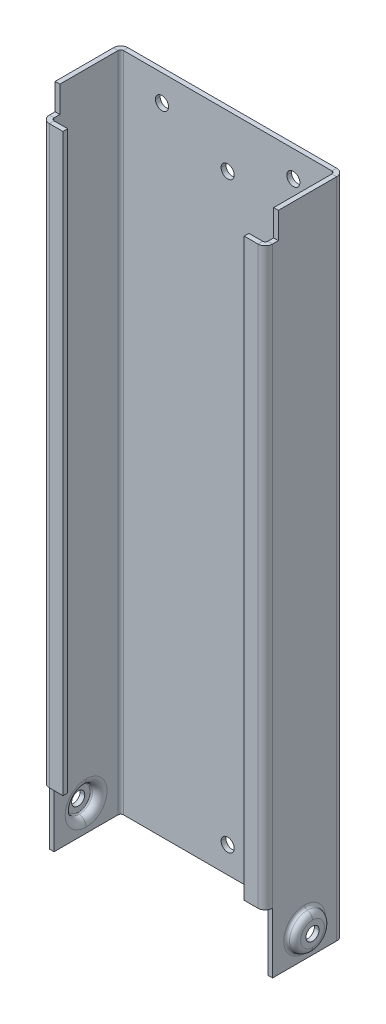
ISO-10303-21;
HEADER;
FILE_DESCRIPTION(('STEP AP214'),'2;1');
FILE_NAME('part.step','',(''),(''),'','','');
FILE_SCHEMA(('AUTOMOTIVE_DESIGN { 1 0 10303 214 1 1 1 1 }'));
ENDSEC;
DATA;
#1=APPLICATION_CONTEXT('core data for automotive mechanical design processes');
#2=APPLICATION_PROTOCOL_DEFINITION('international standard','automotive_design',2000,#1);
#3=PRODUCT_CONTEXT('',#1,'mechanical');
#4=PRODUCT('Part','Part','',(#3));
#5=PRODUCT_RELATED_PRODUCT_CATEGORY('part','',(#4));
#6=PRODUCT_DEFINITION_FORMATION('','',#4);
#7=PRODUCT_DEFINITION_CONTEXT('part definition',#1,'design');
#8=PRODUCT_DEFINITION('design','',#6,#7);
#9=PRODUCT_DEFINITION_SHAPE('','',#8);
#10=(LENGTH_UNIT() NAMED_UNIT(*) SI_UNIT(.MILLI.,.METRE.));
#11=(NAMED_UNIT(*) PLANE_ANGLE_UNIT() SI_UNIT($,.RADIAN.));
#12=(NAMED_UNIT(*) SI_UNIT($,.STERADIAN.) SOLID_ANGLE_UNIT());
#13=UNCERTAINTY_MEASURE_WITH_UNIT(LENGTH_MEASURE(1.E-05),#10,'distance_accuracy_value','');
#14=(GEOMETRIC_REPRESENTATION_CONTEXT(3) GLOBAL_UNCERTAINTY_ASSIGNED_CONTEXT((#13)) GLOBAL_UNIT_ASSIGNED_CONTEXT((#10,
#11,#12)) REPRESENTATION_CONTEXT('',''));
#15=CARTESIAN_POINT('',(0.,0.,0.));
#16=DIRECTION('',(0.,0.,1.));
#17=DIRECTION('',(1.,0.,0.));
#18=AXIS2_PLACEMENT_3D('',#15,#16,#17);
#19=CARTESIAN_POINT('',(0.,10.,0.));
#20=DIRECTION('',(0.,0.,1.));
#21=DIRECTION('',(1.,0.,0.));
#22=AXIS2_PLACEMENT_3D('',#19,#20,#21);
#23=CYLINDRICAL_SURFACE('',#22,2.5);
#24=DIRECTION('',(0.,0.,1.));
#25=VECTOR('',#24,1.);
#26=CARTESIAN_POINT('',(-2.5,10.,0.));
#27=LINE('',#26,#25);
#28=CARTESIAN_POINT('',(-2.5,10.,0.));
#29=VERTEX_POINT('',#28);
#30=CARTESIAN_POINT('',(-2.5,10.,1.8));
#31=VERTEX_POINT('',#30);
#32=EDGE_CURVE('E563',#29,#31,#27,.T.);
#33=ORIENTED_EDGE('',*,*,#32,.F.);
#34=CARTESIAN_POINT('',(0.,10.,0.));
#35=DIRECTION('',(0.,0.,1.));
#36=DIRECTION('',(1.,0.,0.));
#37=AXIS2_PLACEMENT_3D('',#34,#35,#36);
#38=CIRCLE('',#37,2.5);
#39=CARTESIAN_POINT('',(2.5,10.,0.));
#40=VERTEX_POINT('',#39);
#41=EDGE_CURVE('E712',#40,#29,#38,.T.);
#42=ORIENTED_EDGE('',*,*,#41,.F.);
#43=DIRECTION('',(0.,0.,1.));
#44=VECTOR('',#43,1.);
#45=CARTESIAN_POINT('',(2.5,10.,0.));
#46=LINE('',#45,#44);
#47=CARTESIAN_POINT('',(2.5,10.,1.8));
#48=VERTEX_POINT('',#47);
#49=EDGE_CURVE('E760',#40,#48,#46,.T.);
#50=ORIENTED_EDGE('',*,*,#49,.T.);
#51=CARTESIAN_POINT('',(0.,10.,1.8));
#52=DIRECTION('',(0.,0.,1.));
#53=DIRECTION('',(1.,0.,0.));
#54=AXIS2_PLACEMENT_3D('',#51,#52,#53);
#55=CIRCLE('',#54,2.5);
#56=EDGE_CURVE('E682',#48,#31,#55,.T.);
#57=ORIENTED_EDGE('',*,*,#56,.T.);
#58=EDGE_LOOP('',(#33,#42,#50,#57));
#59=FACE_BOUND('',#58,.T.);
#60=ADVANCED_FACE('F15',(#59),#23,.F.);
#61=CARTESIAN_POINT('',(0.,232.,0.));
#62=DIRECTION('',(0.,0.,1.));
#63=DIRECTION('',(1.,0.,0.));
#64=AXIS2_PLACEMENT_3D('',#61,#62,#63);
#65=CYLINDRICAL_SURFACE('',#64,2.5);
#66=DIRECTION('',(0.,0.,1.));
#67=VECTOR('',#66,1.);
#68=CARTESIAN_POINT('',(-2.5,232.,0.));
#69=LINE('',#68,#67);
#70=CARTESIAN_POINT('',(-2.5,232.,0.));
#71=VERTEX_POINT('',#70);
#72=CARTESIAN_POINT('',(-2.5,232.,1.8));
#73=VERTEX_POINT('',#72);
#74=EDGE_CURVE('E937',#71,#73,#69,.T.);
#75=ORIENTED_EDGE('',*,*,#74,.F.);
#76=CARTESIAN_POINT('',(0.,232.,0.));
#77=DIRECTION('',(0.,0.,1.));
#78=DIRECTION('',(1.,0.,0.));
#79=AXIS2_PLACEMENT_3D('',#76,#77,#78);
#80=CIRCLE('',#79,2.5);
#81=CARTESIAN_POINT('',(2.5,232.,0.));
#82=VERTEX_POINT('',#81);
#83=EDGE_CURVE('E709',#82,#71,#80,.T.);
#84=ORIENTED_EDGE('',*,*,#83,.F.);
#85=DIRECTION('',(0.,0.,1.));
#86=VECTOR('',#85,1.);
#87=CARTESIAN_POINT('',(2.5,232.,0.));
#88=LINE('',#87,#86);
#89=CARTESIAN_POINT('',(2.5,232.,1.8));
#90=VERTEX_POINT('',#89);
#91=EDGE_CURVE('E505',#82,#90,#88,.T.);
#92=ORIENTED_EDGE('',*,*,#91,.T.);
#93=CARTESIAN_POINT('',(0.,232.,1.8));
#94=DIRECTION('',(0.,0.,1.));
#95=DIRECTION('',(1.,0.,0.));
#96=AXIS2_PLACEMENT_3D('',#93,#94,#95);
#97=CIRCLE('',#96,2.5);
#98=EDGE_CURVE('E685',#90,#73,#97,.T.);
#99=ORIENTED_EDGE('',*,*,#98,.T.);
#100=EDGE_LOOP('',(#75,#84,#92,#99));
#101=FACE_BOUND('',#100,.T.);
#102=ADVANCED_FACE('F1109',(#101),#65,.F.);
#103=CARTESIAN_POINT('',(-25.,242.,0.));
#104=DIRECTION('',(0.,0.,1.));
#105=DIRECTION('',(1.,0.,0.));
#106=AXIS2_PLACEMENT_3D('',#103,#104,#105);
#107=CYLINDRICAL_SURFACE('',#106,2.5);
#108=DIRECTION('',(0.,0.,1.));
#109=VECTOR('',#108,1.);
#110=CARTESIAN_POINT('',(-27.5,242.,0.));
#111=LINE('',#110,#109);
#112=CARTESIAN_POINT('',(-27.5,242.,0.));
#113=VERTEX_POINT('',#112);
#114=CARTESIAN_POINT('',(-27.5,242.,1.8));
#115=VERTEX_POINT('',#114);
#116=EDGE_CURVE('E642',#113,#115,#111,.T.);
#117=ORIENTED_EDGE('',*,*,#116,.F.);
#118=CARTESIAN_POINT('',(-25.,242.,0.));
#119=DIRECTION('',(0.,0.,1.));
#120=DIRECTION('',(1.,0.,0.));
#121=AXIS2_PLACEMENT_3D('',#118,#119,#120);
#122=CIRCLE('',#121,2.5);
#123=CARTESIAN_POINT('',(-22.5,242.,0.));
#124=VERTEX_POINT('',#123);
#125=EDGE_CURVE('E492',#124,#113,#122,.T.);
#126=ORIENTED_EDGE('',*,*,#125,.F.);
#127=DIRECTION('',(0.,0.,1.));
#128=VECTOR('',#127,1.);
#129=CARTESIAN_POINT('',(-22.5,242.,0.));
#130=LINE('',#129,#128);
#131=CARTESIAN_POINT('',(-22.5,242.,1.8));
#132=VERTEX_POINT('',#131);
#133=EDGE_CURVE('E658',#124,#132,#130,.T.);
#134=ORIENTED_EDGE('',*,*,#133,.T.);
#135=CARTESIAN_POINT('',(-25.,242.,1.8));
#136=DIRECTION('',(0.,0.,1.));
#137=DIRECTION('',(1.,0.,0.));
#138=AXIS2_PLACEMENT_3D('',#135,#136,#137);
#139=CIRCLE('',#138,2.5);
#140=EDGE_CURVE('E218',#132,#115,#139,.T.);
#141=ORIENTED_EDGE('',*,*,#140,.T.);
#142=EDGE_LOOP('',(#117,#126,#134,#141));
#143=FACE_BOUND('',#142,.T.);
#144=ADVANCED_FACE('F1115',(#143),#107,.F.);
#145=CARTESIAN_POINT('',(25.,242.,0.));
#146=DIRECTION('',(0.,0.,1.));
#147=DIRECTION('',(1.,0.,0.));
#148=AXIS2_PLACEMENT_3D('',#145,#146,#147);
#149=CYLINDRICAL_SURFACE('',#148,2.5);
#150=DIRECTION('',(0.,0.,1.));
#151=VECTOR('',#150,1.);
#152=CARTESIAN_POINT('',(22.5,242.,0.));
#153=LINE('',#152,#151);
#154=CARTESIAN_POINT('',(22.5,242.,0.));
#155=VERTEX_POINT('',#154);
#156=CARTESIAN_POINT('',(22.5,242.,1.8));
#157=VERTEX_POINT('',#156);
#158=EDGE_CURVE('E601',#155,#157,#153,.T.);
#159=ORIENTED_EDGE('',*,*,#158,.F.);
#160=CARTESIAN_POINT('',(25.,242.,0.));
#161=DIRECTION('',(0.,0.,1.));
#162=DIRECTION('',(1.,0.,0.));
#163=AXIS2_PLACEMENT_3D('',#160,#161,#162);
#164=CIRCLE('',#163,2.5);
#165=CARTESIAN_POINT('',(27.5,242.,0.));
#166=VERTEX_POINT('',#165);
#167=EDGE_CURVE('E794',#166,#155,#164,.T.);
#168=ORIENTED_EDGE('',*,*,#167,.F.);
#169=DIRECTION('',(0.,0.,1.));
#170=VECTOR('',#169,1.);
#171=CARTESIAN_POINT('',(27.5,242.,0.));
#172=LINE('',#171,#170);
#173=CARTESIAN_POINT('',(27.5,242.,1.8));
#174=VERTEX_POINT('',#173);
#175=EDGE_CURVE('E550',#166,#174,#172,.T.);
#176=ORIENTED_EDGE('',*,*,#175,.T.);
#177=CARTESIAN_POINT('',(25.,242.,1.8));
#178=DIRECTION('',(0.,0.,1.));
#179=DIRECTION('',(1.,0.,0.));
#180=AXIS2_PLACEMENT_3D('',#177,#178,#179);
#181=CIRCLE('',#180,2.5);
#182=EDGE_CURVE('E715',#174,#157,#181,.T.);
#183=ORIENTED_EDGE('',*,*,#182,.T.);
#184=EDGE_LOOP('',(#159,#168,#176,#183));
#185=FACE_BOUND('',#184,.T.);
#186=ADVANCED_FACE('F1328',(#185),#149,.F.);
#187=CARTESIAN_POINT('',(-45.5000000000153,10.,15.));
#188=DIRECTION('',(1.,0.,0.));
#189=DIRECTION('',(0.,0.,-1.));
#190=AXIS2_PLACEMENT_3D('',#187,#188,#189);
#191=CYLINDRICAL_SURFACE('',#190,2.5);
#192=DIRECTION('',(1.,0.,0.));
#193=VECTOR('',#192,1.);
#194=CARTESIAN_POINT('',(-45.5000000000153,10.,17.5));
#195=LINE('',#194,#193);
#196=CARTESIAN_POINT('',(-45.5000000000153,10.,17.5));
#197=VERTEX_POINT('',#196);
#198=CARTESIAN_POINT('',(-43.7000000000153,10.,17.5));
#199=VERTEX_POINT('',#198);
#200=EDGE_CURVE('E532',#197,#199,#195,.T.);
#201=ORIENTED_EDGE('',*,*,#200,.F.);
#202=CARTESIAN_POINT('',(-45.5000000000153,10.,15.));
#203=DIRECTION('',(1.,0.,0.));
#204=DIRECTION('',(0.,0.,-1.));
#205=AXIS2_PLACEMENT_3D('',#202,#203,#204);
#206=CIRCLE('',#205,2.5);
#207=CARTESIAN_POINT('',(-45.5000000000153,10.,12.5));
#208=VERTEX_POINT('',#207);
#209=EDGE_CURVE('E908',#208,#197,#206,.T.);
#210=ORIENTED_EDGE('',*,*,#209,.F.);
#211=DIRECTION('',(1.,0.,0.));
#212=VECTOR('',#211,1.);
#213=CARTESIAN_POINT('',(-45.5000000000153,10.,12.5));
#214=LINE('',#213,#212);
#215=CARTESIAN_POINT('',(-43.7000000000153,10.,12.5));
#216=VERTEX_POINT('',#215);
#217=EDGE_CURVE('E546',#208,#216,#214,.T.);
#218=ORIENTED_EDGE('',*,*,#217,.T.);
#219=CARTESIAN_POINT('',(-43.7000000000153,10.,15.));
#220=DIRECTION('',(-1.,0.,0.));
#221=DIRECTION('',(0.,0.,1.));
#222=AXIS2_PLACEMENT_3D('',#219,#220,#221);
#223=CIRCLE('',#222,2.5);
#224=EDGE_CURVE('E668',#199,#216,#223,.T.);
#225=ORIENTED_EDGE('',*,*,#224,.F.);
#226=EDGE_LOOP('',(#201,#210,#218,#225));
#227=FACE_BOUND('',#226,.T.);
#228=ADVANCED_FACE('F1322',(#227),#191,.F.);
#229=CARTESIAN_POINT('',(-45.5000000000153,10.,15.));
#230=DIRECTION('',(1.,0.,0.));
#231=DIRECTION('',(0.,0.,-1.));
#232=AXIS2_PLACEMENT_3D('',#229,#230,#231);
#233=CYLINDRICAL_SURFACE('',#232,2.5);
#234=DIRECTION('',(1.,0.,0.));
#235=VECTOR('',#234,1.);
#236=CARTESIAN_POINT('',(-45.5000000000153,10.,17.5));
#237=LINE('',#236,#235);
#238=CARTESIAN_POINT('',(43.7000000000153,10.,17.5));
#239=VERTEX_POINT('',#238);
#240=CARTESIAN_POINT('',(45.5000000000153,10.,17.5));
#241=VERTEX_POINT('',#240);
#242=EDGE_CURVE('E516',#239,#241,#237,.T.);
#243=ORIENTED_EDGE('',*,*,#242,.F.);
#244=CARTESIAN_POINT('',(43.7000000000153,10.,15.));
#245=DIRECTION('',(1.,0.,0.));
#246=DIRECTION('',(0.,0.,-1.));
#247=AXIS2_PLACEMENT_3D('',#244,#245,#246);
#248=CIRCLE('',#247,2.5);
#249=CARTESIAN_POINT('',(43.7000000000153,10.,12.5));
#250=VERTEX_POINT('',#249);
#251=EDGE_CURVE('E1001',#250,#239,#248,.T.);
#252=ORIENTED_EDGE('',*,*,#251,.F.);
#253=DIRECTION('',(1.,0.,0.));
#254=VECTOR('',#253,1.);
#255=CARTESIAN_POINT('',(-45.5000000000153,10.,12.5));
#256=LINE('',#255,#254);
#257=CARTESIAN_POINT('',(45.5000000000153,10.,12.5));
#258=VERTEX_POINT('',#257);
#259=EDGE_CURVE('E515',#250,#258,#256,.T.);
#260=ORIENTED_EDGE('',*,*,#259,.T.);
#261=CARTESIAN_POINT('',(45.5000000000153,10.,15.));
#262=DIRECTION('',(1.,0.,0.));
#263=DIRECTION('',(0.,0.,-1.));
#264=AXIS2_PLACEMENT_3D('',#261,#262,#263);
#265=CIRCLE('',#264,2.5);
#266=EDGE_CURVE('E826',#258,#241,#265,.T.);
#267=ORIENTED_EDGE('',*,*,#266,.T.);
#268=EDGE_LOOP('',(#243,#252,#260,#267));
#269=FACE_BOUND('',#268,.T.);
#270=ADVANCED_FACE('F1327',(#269),#233,.F.);
#271=CARTESIAN_POINT('',(-45.5000000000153,242.,25.));
#272=DIRECTION('',(0.,-1.,0.));
#273=DIRECTION('',(0.,0.,-1.));
#274=AXIS2_PLACEMENT_3D('',#271,#272,#273);
#275=PLANE('',#274);
#276=DIRECTION('',(0.,0.,1.));
#277=VECTOR('',#276,1.);
#278=CARTESIAN_POINT('',(-39.7,242.,28.2));
#279=LINE('',#278,#277);
#280=CARTESIAN_POINT('',(-39.7,242.,28.2));
#281=VERTEX_POINT('',#280);
#282=CARTESIAN_POINT('',(-39.7,242.,30.));
#283=VERTEX_POINT('',#282);
#284=EDGE_CURVE('E494',#281,#283,#279,.T.);
#285=ORIENTED_EDGE('',*,*,#284,.F.);
#286=CARTESIAN_POINT('',(-39.7,242.,27.2));
#287=DIRECTION('',(0.,1.,0.));
#288=DIRECTION('',(0.,0.,-1.));
#289=AXIS2_PLACEMENT_3D('',#286,#287,#288);
#290=CIRCLE('',#289,1.);
#291=CARTESIAN_POINT('',(-40.7,242.,27.2));
#292=VERTEX_POINT('',#291);
#293=EDGE_CURVE('E976',#292,#281,#290,.T.);
#294=ORIENTED_EDGE('',*,*,#293,.F.);
#295=DIRECTION('',(1.,0.,0.));
#296=VECTOR('',#295,1.);
#297=CARTESIAN_POINT('',(-42.5,242.,27.2));
#298=LINE('',#297,#296);
#299=CARTESIAN_POINT('',(-42.5,242.,27.2));
#300=VERTEX_POINT('',#299);
#301=EDGE_CURVE('E585',#300,#292,#298,.T.);
#302=ORIENTED_EDGE('',*,*,#301,.F.);
#303=CARTESIAN_POINT('',(-39.7,242.,27.2));
#304=DIRECTION('',(0.,1.,0.));
#305=DIRECTION('',(0.,0.,-1.));
#306=AXIS2_PLACEMENT_3D('',#303,#304,#305);
#307=CIRCLE('',#306,2.8);
#308=EDGE_CURVE('E890',#300,#283,#307,.T.);
#309=ORIENTED_EDGE('',*,*,#308,.T.);
#310=EDGE_LOOP('',(#285,#294,#302,#309));
#311=FACE_BOUND('',#310,.T.);
#312=ADVANCED_FACE('F1651',(#311),#275,.F.);
#313=CARTESIAN_POINT('',(-45.5000000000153,252.,25.));
#314=DIRECTION('',(0.,0.,-1.));
#315=DIRECTION('',(0.,-1.,0.));
#316=AXIS2_PLACEMENT_3D('',#313,#314,#315);
#317=PLANE('',#316);
#318=DIRECTION('',(0.,-1.,0.));
#319=VECTOR('',#318,1.);
#320=CARTESIAN_POINT('',(-42.5,252.,25.));
#321=LINE('',#320,#319);
#322=CARTESIAN_POINT('',(-42.5,252.,25.));
#323=VERTEX_POINT('',#322);
#324=CARTESIAN_POINT('',(-42.5,242.,25.));
#325=VERTEX_POINT('',#324);
#326=EDGE_CURVE('E416',#323,#325,#321,.T.);
#327=ORIENTED_EDGE('',*,*,#326,.T.);
#328=DIRECTION('',(1.,0.,0.));
#329=VECTOR('',#328,1.);
#330=CARTESIAN_POINT('',(-45.5000000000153,242.,25.));
#331=LINE('',#330,#329);
#332=CARTESIAN_POINT('',(-40.7,242.,25.));
#333=VERTEX_POINT('',#332);
#334=EDGE_CURVE('E584',#325,#333,#331,.T.);
#335=ORIENTED_EDGE('',*,*,#334,.T.);
#336=DIRECTION('',(0.,-1.,0.));
#337=VECTOR('',#336,1.);
#338=CARTESIAN_POINT('',(-40.7,252.,25.));
#339=LINE('',#338,#337);
#340=CARTESIAN_POINT('',(-40.7,252.,25.));
#341=VERTEX_POINT('',#340);
#342=EDGE_CURVE('E428',#341,#333,#339,.T.);
#343=ORIENTED_EDGE('',*,*,#342,.F.);
#344=DIRECTION('',(1.,0.,0.));
#345=VECTOR('',#344,1.);
#346=CARTESIAN_POINT('',(-45.5000000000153,252.,25.));
#347=LINE('',#346,#345);
#348=EDGE_CURVE('E586',#323,#341,#347,.T.);
#349=ORIENTED_EDGE('',*,*,#348,.F.);
#350=EDGE_LOOP('',(#327,#335,#343,#349));
#351=FACE_BOUND('',#350,.T.);
#352=ADVANCED_FACE('F1170',(#351),#317,.F.);
#353=CARTESIAN_POINT('',(-45.5000000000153,0.,27.2));
#354=DIRECTION('',(0.,0.,-1.));
#355=DIRECTION('',(0.,-1.,0.));
#356=AXIS2_PLACEMENT_3D('',#353,#354,#355);
#357=PLANE('',#356);
#358=DIRECTION('',(0.,-1.,0.));
#359=VECTOR('',#358,1.);
#360=CARTESIAN_POINT('',(-42.5,252.,27.2));
#361=LINE('',#360,#359);
#362=CARTESIAN_POINT('',(-42.5,23.,27.2));
#363=VERTEX_POINT('',#362);
#364=CARTESIAN_POINT('',(-42.5,0.,27.2));
#365=VERTEX_POINT('',#364);
#366=EDGE_CURVE('E469',#363,#365,#361,.T.);
#367=ORIENTED_EDGE('',*,*,#366,.T.);
#368=DIRECTION('',(-1.,0.,0.));
#369=VECTOR('',#368,1.);
#370=CARTESIAN_POINT('',(-40.7,0.,27.2));
#371=LINE('',#370,#369);
#372=CARTESIAN_POINT('',(-40.7,0.,27.2));
#373=VERTEX_POINT('',#372);
#374=EDGE_CURVE('E466',#373,#365,#371,.T.);
#375=ORIENTED_EDGE('',*,*,#374,.F.);
#376=DIRECTION('',(0.,-1.,0.));
#377=VECTOR('',#376,1.);
#378=CARTESIAN_POINT('',(-40.7,252.,27.2));
#379=LINE('',#378,#377);
#380=CARTESIAN_POINT('',(-40.7,23.,27.2));
#381=VERTEX_POINT('',#380);
#382=EDGE_CURVE('E451',#381,#373,#379,.T.);
#383=ORIENTED_EDGE('',*,*,#382,.F.);
#384=DIRECTION('',(1.,0.,0.));
#385=VECTOR('',#384,1.);
#386=CARTESIAN_POINT('',(-45.5000000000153,23.,27.2));
#387=LINE('',#386,#385);
#388=EDGE_CURVE('E10',#363,#381,#387,.T.);
#389=ORIENTED_EDGE('',*,*,#388,.F.);
#390=EDGE_LOOP('',(#367,#375,#383,#389));
#391=FACE_BOUND('',#390,.T.);
#392=ADVANCED_FACE('F467',(#391),#357,.F.);
#393=CARTESIAN_POINT('',(-45.5000000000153,23.,30.));
#394=DIRECTION('',(0.,1.,0.));
#395=DIRECTION('',(1.,0.,0.));
#396=AXIS2_PLACEMENT_3D('',#393,#394,#395);
#397=PLANE('',#396);
#398=DIRECTION('',(0.,0.,-1.));
#399=VECTOR('',#398,1.);
#400=CARTESIAN_POINT('',(-39.7,23.,30.));
#401=LINE('',#400,#399);
#402=CARTESIAN_POINT('',(-39.7,23.,30.));
#403=VERTEX_POINT('',#402);
#404=CARTESIAN_POINT('',(-39.7,23.,28.2));
#405=VERTEX_POINT('',#404);
#406=EDGE_CURVE('E619',#403,#405,#401,.T.);
#407=ORIENTED_EDGE('',*,*,#406,.F.);
#408=CARTESIAN_POINT('',(-39.7,23.,27.2));
#409=DIRECTION('',(0.,-1.,0.));
#410=DIRECTION('',(0.,0.,1.));
#411=AXIS2_PLACEMENT_3D('',#408,#409,#410);
#412=CIRCLE('',#411,2.8);
#413=EDGE_CURVE('E729',#403,#363,#412,.T.);
#414=ORIENTED_EDGE('',*,*,#413,.T.);
#415=ORIENTED_EDGE('',*,*,#388,.T.);
#416=CARTESIAN_POINT('',(-39.7,23.,27.2));
#417=DIRECTION('',(0.,-1.,0.));
#418=DIRECTION('',(0.,0.,1.));
#419=AXIS2_PLACEMENT_3D('',#416,#417,#418);
#420=CIRCLE('',#419,1.);
#421=EDGE_CURVE('E798',#405,#381,#420,.T.);
#422=ORIENTED_EDGE('',*,*,#421,.F.);
#423=EDGE_LOOP('',(#407,#414,#415,#422));
#424=FACE_BOUND('',#423,.T.);
#425=ADVANCED_FACE('F1160',(#424),#397,.F.);
#426=CARTESIAN_POINT('',(-45.5000000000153,252.,25.));
#427=DIRECTION('',(0.,0.,-1.));
#428=DIRECTION('',(0.,-1.,0.));
#429=AXIS2_PLACEMENT_3D('',#426,#427,#428);
#430=PLANE('',#429);
#431=DIRECTION('',(0.,1.,0.));
#432=VECTOR('',#431,1.);
#433=CARTESIAN_POINT('',(42.5,252.,25.));
#434=LINE('',#433,#432);
#435=CARTESIAN_POINT('',(42.5,242.,25.));
#436=VERTEX_POINT('',#435);
#437=CARTESIAN_POINT('',(42.5,252.,25.));
#438=VERTEX_POINT('',#437);
#439=EDGE_CURVE('E360',#436,#438,#434,.T.);
#440=ORIENTED_EDGE('',*,*,#439,.T.);
#441=DIRECTION('',(1.,0.,0.));
#442=VECTOR('',#441,1.);
#443=CARTESIAN_POINT('',(-45.5000000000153,252.,25.));
#444=LINE('',#443,#442);
#445=CARTESIAN_POINT('',(40.7,252.,25.));
#446=VERTEX_POINT('',#445);
#447=EDGE_CURVE('E954',#446,#438,#444,.T.);
#448=ORIENTED_EDGE('',*,*,#447,.F.);
#449=DIRECTION('',(0.,1.,0.));
#450=VECTOR('',#449,1.);
#451=CARTESIAN_POINT('',(40.7,252.,25.));
#452=LINE('',#451,#450);
#453=CARTESIAN_POINT('',(40.7,242.,25.));
#454=VERTEX_POINT('',#453);
#455=EDGE_CURVE('E531',#454,#446,#452,.T.);
#456=ORIENTED_EDGE('',*,*,#455,.F.);
#457=DIRECTION('',(1.,0.,0.));
#458=VECTOR('',#457,1.);
#459=CARTESIAN_POINT('',(-45.5000000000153,242.,25.));
#460=LINE('',#459,#458);
#461=EDGE_CURVE('E565',#454,#436,#460,.T.);
#462=ORIENTED_EDGE('',*,*,#461,.T.);
#463=EDGE_LOOP('',(#440,#448,#456,#462));
#464=FACE_BOUND('',#463,.T.);
#465=ADVANCED_FACE('F1162',(#464),#430,.F.);
#466=CARTESIAN_POINT('',(-45.5000000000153,242.,25.));
#467=DIRECTION('',(0.,-1.,0.));
#468=DIRECTION('',(0.,0.,-1.));
#469=AXIS2_PLACEMENT_3D('',#466,#467,#468);
#470=PLANE('',#469);
#471=DIRECTION('',(1.,0.,0.));
#472=VECTOR('',#471,1.);
#473=CARTESIAN_POINT('',(40.7,242.,27.2));
#474=LINE('',#473,#472);
#475=CARTESIAN_POINT('',(40.7,242.,27.2));
#476=VERTEX_POINT('',#475);
#477=CARTESIAN_POINT('',(42.5,242.,27.2));
#478=VERTEX_POINT('',#477);
#479=EDGE_CURVE('E612',#476,#478,#474,.T.);
#480=ORIENTED_EDGE('',*,*,#479,.F.);
#481=CARTESIAN_POINT('',(39.7,242.,27.2));
#482=DIRECTION('',(0.,1.,0.));
#483=DIRECTION('',(0.,0.,-1.));
#484=AXIS2_PLACEMENT_3D('',#481,#482,#483);
#485=CIRCLE('',#484,1.);
#486=CARTESIAN_POINT('',(39.7,242.,28.2));
#487=VERTEX_POINT('',#486);
#488=EDGE_CURVE('E618',#487,#476,#485,.T.);
#489=ORIENTED_EDGE('',*,*,#488,.F.);
#490=DIRECTION('',(0.,0.,-1.));
#491=VECTOR('',#490,1.);
#492=CARTESIAN_POINT('',(39.7,242.,30.));
#493=LINE('',#492,#491);
#494=CARTESIAN_POINT('',(39.7,242.,30.));
#495=VERTEX_POINT('',#494);
#496=EDGE_CURVE('E775',#495,#487,#493,.T.);
#497=ORIENTED_EDGE('',*,*,#496,.F.);
#498=CARTESIAN_POINT('',(39.7,242.,27.2));
#499=DIRECTION('',(0.,1.,0.));
#500=DIRECTION('',(0.,0.,-1.));
#501=AXIS2_PLACEMENT_3D('',#498,#499,#500);
#502=CIRCLE('',#501,2.8);
#503=EDGE_CURVE('E606',#495,#478,#502,.T.);
#504=ORIENTED_EDGE('',*,*,#503,.T.);
#505=EDGE_LOOP('',(#480,#489,#497,#504));
#506=FACE_BOUND('',#505,.T.);
#507=ADVANCED_FACE('F1168',(#506),#470,.F.);
#508=CARTESIAN_POINT('',(-45.5000000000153,23.,30.));
#509=DIRECTION('',(0.,1.,0.));
#510=DIRECTION('',(1.,0.,0.));
#511=AXIS2_PLACEMENT_3D('',#508,#509,#510);
#512=PLANE('',#511);
#513=CARTESIAN_POINT('',(39.7,23.,27.2));
#514=DIRECTION('',(0.,-1.,0.));
#515=DIRECTION('',(0.,0.,1.));
#516=AXIS2_PLACEMENT_3D('',#513,#514,#515);
#517=CIRCLE('',#516,2.8);
#518=CARTESIAN_POINT('',(42.5,23.,27.2));
#519=VERTEX_POINT('',#518);
#520=CARTESIAN_POINT('',(39.7,23.,30.));
#521=VERTEX_POINT('',#520);
#522=EDGE_CURVE('E768',#519,#521,#517,.T.);
#523=ORIENTED_EDGE('',*,*,#522,.T.);
#524=DIRECTION('',(1.,0.,0.));
#525=VECTOR('',#524,1.);
#526=CARTESIAN_POINT('',(-45.5000000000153,23.,30.));
#527=LINE('',#526,#525);
#528=CARTESIAN_POINT('',(34.5,23.,30.));
#529=VERTEX_POINT('',#528);
#530=EDGE_CURVE('E607',#529,#521,#527,.T.);
#531=ORIENTED_EDGE('',*,*,#530,.F.);
#532=DIRECTION('',(0.,0.,-1.));
#533=VECTOR('',#532,1.);
#534=CARTESIAN_POINT('',(34.5,23.,30.));
#535=LINE('',#534,#533);
#536=CARTESIAN_POINT('',(34.5,23.,28.2));
#537=VERTEX_POINT('',#536);
#538=EDGE_CURVE('E664',#529,#537,#535,.T.);
#539=ORIENTED_EDGE('',*,*,#538,.T.);
#540=DIRECTION('',(-1.,0.,0.));
#541=VECTOR('',#540,1.);
#542=CARTESIAN_POINT('',(42.5,23.,28.2));
#543=LINE('',#542,#541);
#544=CARTESIAN_POINT('',(39.7,23.,28.2));
#545=VERTEX_POINT('',#544);
#546=EDGE_CURVE('E667',#545,#537,#543,.T.);
#547=ORIENTED_EDGE('',*,*,#546,.F.);
#548=CARTESIAN_POINT('',(39.7,23.,27.2));
#549=DIRECTION('',(0.,-1.,0.));
#550=DIRECTION('',(0.,0.,1.));
#551=AXIS2_PLACEMENT_3D('',#548,#549,#550);
#552=CIRCLE('',#551,1.);
#553=CARTESIAN_POINT('',(40.7,23.,27.2));
#554=VERTEX_POINT('',#553);
#555=EDGE_CURVE('E993',#554,#545,#552,.T.);
#556=ORIENTED_EDGE('',*,*,#555,.F.);
#557=DIRECTION('',(1.,0.,0.));
#558=VECTOR('',#557,1.);
#559=CARTESIAN_POINT('',(-45.5000000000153,23.,27.2));
#560=LINE('',#559,#558);
#561=EDGE_CURVE('E26',#554,#519,#560,.T.);
#562=ORIENTED_EDGE('',*,*,#561,.T.);
#563=EDGE_LOOP('',(#523,#531,#539,#547,#556,#562));
#564=FACE_BOUND('',#563,.T.);
#565=ADVANCED_FACE('F1397',(#564),#512,.F.);
#566=CARTESIAN_POINT('',(-45.5000000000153,0.,27.2));
#567=DIRECTION('',(0.,0.,-1.));
#568=DIRECTION('',(0.,-1.,0.));
#569=AXIS2_PLACEMENT_3D('',#566,#567,#568);
#570=PLANE('',#569);
#571=DIRECTION('',(0.,1.,0.));
#572=VECTOR('',#571,1.);
#573=CARTESIAN_POINT('',(42.5,252.,27.2));
#574=LINE('',#573,#572);
#575=CARTESIAN_POINT('',(42.5,0.,27.2));
#576=VERTEX_POINT('',#575);
#577=EDGE_CURVE('E575',#576,#519,#574,.T.);
#578=ORIENTED_EDGE('',*,*,#577,.T.);
#579=ORIENTED_EDGE('',*,*,#561,.F.);
#580=DIRECTION('',(0.,-1.,0.));
#581=VECTOR('',#580,1.);
#582=CARTESIAN_POINT('',(40.7,252.,27.2));
#583=LINE('',#582,#581);
#584=CARTESIAN_POINT('',(40.7,0.,27.2));
#585=VERTEX_POINT('',#584);
#586=EDGE_CURVE('E528',#554,#585,#583,.T.);
#587=ORIENTED_EDGE('',*,*,#586,.T.);
#588=DIRECTION('',(-1.,0.,0.));
#589=VECTOR('',#588,1.);
#590=CARTESIAN_POINT('',(42.5,0.,27.2));
#591=LINE('',#590,#589);
#592=EDGE_CURVE('E19',#576,#585,#591,.T.);
#593=ORIENTED_EDGE('',*,*,#592,.F.);
#594=EDGE_LOOP('',(#578,#579,#587,#593));
#595=FACE_BOUND('',#594,.T.);
#596=ADVANCED_FACE('F1249',(#595),#570,.F.);
#597=CARTESIAN_POINT('',(43.7000000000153,10.,15.));
#598=DIRECTION('',(1.,0.,0.));
#599=DIRECTION('',(0.,0.,1.));
#600=AXIS2_PLACEMENT_3D('',#597,#598,#599);
#601=PLANE('',#600);
#602=ORIENTED_EDGE('',*,*,#251,.T.);
#603=CARTESIAN_POINT('',(43.7000000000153,10.,15.));
#604=DIRECTION('',(1.,0.,0.));
#605=DIRECTION('',(0.,0.,-1.));
#606=AXIS2_PLACEMENT_3D('',#603,#604,#605);
#607=CIRCLE('',#606,2.5);
#608=EDGE_CURVE('E948',#239,#250,#607,.T.);
#609=ORIENTED_EDGE('',*,*,#608,.T.);
#610=EDGE_LOOP('',(#602,#609));
#611=FACE_BOUND('',#610,.T.);
#612=CARTESIAN_POINT('',(43.7000000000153,10.,15.));
#613=DIRECTION('',(-1.,0.,0.));
#614=DIRECTION('',(0.,-1.,0.));
#615=AXIS2_PLACEMENT_3D('',#612,#613,#614);
#616=CIRCLE('',#615,4.5);
#617=CARTESIAN_POINT('',(43.7000000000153,5.5,15.));
#618=VERTEX_POINT('',#617);
#619=CARTESIAN_POINT('',(43.7000000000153,14.5,15.));
#620=VERTEX_POINT('',#619);
#621=EDGE_CURVE('E701',#618,#620,#616,.T.);
#622=ORIENTED_EDGE('',*,*,#621,.T.);
#623=CARTESIAN_POINT('',(43.7000000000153,10.,15.));
#624=DIRECTION('',(-1.,0.,0.));
#625=DIRECTION('',(0.,-1.,0.));
#626=AXIS2_PLACEMENT_3D('',#623,#624,#625);
#627=CIRCLE('',#626,4.5);
#628=EDGE_CURVE('E830',#620,#618,#627,.T.);
#629=ORIENTED_EDGE('',*,*,#628,.T.);
#630=EDGE_LOOP('',(#622,#629));
#631=FACE_BOUND('',#630,.T.);
#632=ADVANCED_FACE('F1829',(#611,#631),#601,.F.);
#633=CARTESIAN_POINT('',(43.2000000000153,10.,15.));
#634=DIRECTION('',(1.,0.,0.));
#635=DIRECTION('',(0.,-1.,0.));
#636=AXIS2_PLACEMENT_3D('',#633,#634,#635);
#637=TOROIDAL_SURFACE('',#636,4.5,0.5);
#638=CARTESIAN_POINT('',(43.2000000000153,14.5,15.));
#639=DIRECTION('',(0.,0.,-1.));
#640=DIRECTION('',(-1.,0.,0.));
#641=AXIS2_PLACEMENT_3D('',#638,#639,#640);
#642=CIRCLE('',#641,0.5);
#643=CARTESIAN_POINT('',(43.2714285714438,14.9948716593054,15.));
#644=VERTEX_POINT('',#643);
#645=EDGE_CURVE('E799',#644,#620,#642,.T.);
#646=ORIENTED_EDGE('',*,*,#645,.F.);
#647=CARTESIAN_POINT('',(43.2714285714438,10.,15.));
#648=DIRECTION('',(-1.,0.,0.));
#649=DIRECTION('',(0.,1.,0.));
#650=AXIS2_PLACEMENT_3D('',#647,#648,#649);
#651=CIRCLE('',#650,4.99487165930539);
#652=CARTESIAN_POINT('',(43.2714285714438,5.00512834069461,15.));
#653=VERTEX_POINT('',#652);
#654=EDGE_CURVE('E596',#644,#653,#651,.T.);
#655=ORIENTED_EDGE('',*,*,#654,.T.);
#656=CARTESIAN_POINT('',(43.2000000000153,5.5,15.));
#657=DIRECTION('',(0.,0.,1.));
#658=DIRECTION('',(1.,0.,0.));
#659=AXIS2_PLACEMENT_3D('',#656,#657,#658);
#660=CIRCLE('',#659,0.5);
#661=EDGE_CURVE('E697',#653,#618,#660,.T.);
#662=ORIENTED_EDGE('',*,*,#661,.T.);
#663=ORIENTED_EDGE('',*,*,#628,.F.);
#664=EDGE_LOOP('',(#646,#655,#662,#663));
#665=FACE_BOUND('',#664,.T.);
#666=ADVANCED_FACE('F1158',(#665),#637,.F.);
#667=CARTESIAN_POINT('',(43.7000000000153,10.,15.));
#668=DIRECTION('',(-1.,0.,0.));
#669=DIRECTION('',(0.,1.,0.));
#670=AXIS2_PLACEMENT_3D('',#667,#668,#669);
#671=TOROIDAL_SURFACE('',#670,7.96410161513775,1.2);
#672=CARTESIAN_POINT('',(43.7000000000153,2.03589838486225,15.));
#673=DIRECTION('',(0.,0.,-1.));
#674=DIRECTION('',(-1.,0.,0.));
#675=AXIS2_PLACEMENT_3D('',#672,#673,#674);
#676=CIRCLE('',#675,1.2);
#677=CARTESIAN_POINT('',(42.5000000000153,2.03589838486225,15.));
#678=VERTEX_POINT('',#677);
#679=CARTESIAN_POINT('',(43.5285714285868,3.22359036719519,15.));
#680=VERTEX_POINT('',#679);
#681=EDGE_CURVE('E874',#678,#680,#676,.T.);
#682=ORIENTED_EDGE('',*,*,#681,.F.);
#683=CARTESIAN_POINT('',(42.5000000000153,10.,15.));
#684=DIRECTION('',(-1.,0.,0.));
#685=DIRECTION('',(0.,0.,1.));
#686=AXIS2_PLACEMENT_3D('',#683,#684,#685);
#687=CIRCLE('',#686,7.96410161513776);
#688=CARTESIAN_POINT('',(42.5000000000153,17.9641016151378,15.));
#689=VERTEX_POINT('',#688);
#690=EDGE_CURVE('E672',#689,#678,#687,.T.);
#691=ORIENTED_EDGE('',*,*,#690,.F.);
#692=CARTESIAN_POINT('',(43.7000000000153,17.9641016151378,15.));
#693=DIRECTION('',(0.,0.,1.));
#694=DIRECTION('',(1.,0.,0.));
#695=AXIS2_PLACEMENT_3D('',#692,#693,#694);
#696=CIRCLE('',#695,1.2);
#697=CARTESIAN_POINT('',(43.5285714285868,16.7764096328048,15.));
#698=VERTEX_POINT('',#697);
#699=EDGE_CURVE('E850',#689,#698,#696,.T.);
#700=ORIENTED_EDGE('',*,*,#699,.T.);
#701=CARTESIAN_POINT('',(43.5285714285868,10.,15.));
#702=DIRECTION('',(-1.,0.,0.));
#703=DIRECTION('',(0.,0.,1.));
#704=AXIS2_PLACEMENT_3D('',#701,#702,#703);
#705=CIRCLE('',#704,6.77640963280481);
#706=EDGE_CURVE('E853',#698,#680,#705,.T.);
#707=ORIENTED_EDGE('',*,*,#706,.T.);
#708=EDGE_LOOP('',(#682,#691,#700,#707));
#709=FACE_BOUND('',#708,.T.);
#710=ADVANCED_FACE('F1155',(#709),#671,.F.);
#711=CARTESIAN_POINT('',(43.2000000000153,10.,15.));
#712=DIRECTION('',(1.,0.,0.));
#713=DIRECTION('',(0.,-1.,0.));
#714=AXIS2_PLACEMENT_3D('',#711,#712,#713);
#715=TOROIDAL_SURFACE('',#714,4.5,2.3);
#716=CARTESIAN_POINT('',(43.2000000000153,14.5,15.));
#717=DIRECTION('',(0.,0.,-1.));
#718=DIRECTION('',(-1.,0.,0.));
#719=AXIS2_PLACEMENT_3D('',#716,#717,#718);
#720=CIRCLE('',#719,2.3);
#721=CARTESIAN_POINT('',(45.5000000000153,14.5,15.));
#722=VERTEX_POINT('',#721);
#723=EDGE_CURVE('E721',#698,#722,#720,.T.);
#724=ORIENTED_EDGE('',*,*,#723,.F.);
#725=CARTESIAN_POINT('',(43.5285714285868,10.,15.));
#726=DIRECTION('',(-1.,0.,0.));
#727=DIRECTION('',(0.,0.,1.));
#728=AXIS2_PLACEMENT_3D('',#725,#726,#727);
#729=CIRCLE('',#728,6.77640963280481);
#730=EDGE_CURVE('E854',#680,#698,#729,.T.);
#731=ORIENTED_EDGE('',*,*,#730,.F.);
#732=CARTESIAN_POINT('',(43.2000000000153,5.5,15.));
#733=DIRECTION('',(0.,0.,1.));
#734=DIRECTION('',(1.,0.,0.));
#735=AXIS2_PLACEMENT_3D('',#732,#733,#734);
#736=CIRCLE('',#735,2.3);
#737=CARTESIAN_POINT('',(45.5000000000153,5.5,15.));
#738=VERTEX_POINT('',#737);
#739=EDGE_CURVE('E720',#680,#738,#736,.T.);
#740=ORIENTED_EDGE('',*,*,#739,.T.);
#741=CARTESIAN_POINT('',(45.5000000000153,10.,15.));
#742=DIRECTION('',(-1.,0.,0.));
#743=DIRECTION('',(0.,0.,-1.));
#744=AXIS2_PLACEMENT_3D('',#741,#742,#743);
#745=CIRCLE('',#744,4.5);
#746=EDGE_CURVE('E671',#738,#722,#745,.T.);
#747=ORIENTED_EDGE('',*,*,#746,.T.);
#748=EDGE_LOOP('',(#724,#731,#740,#747));
#749=FACE_BOUND('',#748,.T.);
#750=ADVANCED_FACE('F1157',(#749),#715,.T.);
#751=CARTESIAN_POINT('',(45.5000000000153,10.,15.));
#752=DIRECTION('',(1.,0.,0.));
#753=DIRECTION('',(0.,0.,1.));
#754=AXIS2_PLACEMENT_3D('',#751,#752,#753);
#755=PLANE('',#754);
#756=ORIENTED_EDGE('',*,*,#266,.F.);
#757=CARTESIAN_POINT('',(45.5000000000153,10.,15.));
#758=DIRECTION('',(1.,0.,0.));
#759=DIRECTION('',(0.,0.,-1.));
#760=AXIS2_PLACEMENT_3D('',#757,#758,#759);
#761=CIRCLE('',#760,2.5);
#762=EDGE_CURVE('E511',#241,#258,#761,.T.);
#763=ORIENTED_EDGE('',*,*,#762,.F.);
#764=EDGE_LOOP('',(#756,#763));
#765=FACE_BOUND('',#764,.T.);
#766=ORIENTED_EDGE('',*,*,#746,.F.);
#767=CARTESIAN_POINT('',(45.5000000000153,10.,15.));
#768=DIRECTION('',(-1.,0.,0.));
#769=DIRECTION('',(0.,0.,-1.));
#770=AXIS2_PLACEMENT_3D('',#767,#768,#769);
#771=CIRCLE('',#770,4.5);
#772=EDGE_CURVE('E716',#722,#738,#771,.T.);
#773=ORIENTED_EDGE('',*,*,#772,.F.);
#774=EDGE_LOOP('',(#766,#773));
#775=FACE_BOUND('',#774,.T.);
#776=ADVANCED_FACE('F1628',(#765,#775),#755,.T.);
#777=CARTESIAN_POINT('',(43.7000000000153,10.,15.));
#778=DIRECTION('',(-1.,0.,0.));
#779=DIRECTION('',(0.,1.,0.));
#780=AXIS2_PLACEMENT_3D('',#777,#778,#779);
#781=TOROIDAL_SURFACE('',#780,7.96410161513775,3.);
#782=CARTESIAN_POINT('',(43.7000000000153,2.03589838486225,15.));
#783=DIRECTION('',(0.,0.,-1.));
#784=DIRECTION('',(-1.,0.,0.));
#785=AXIS2_PLACEMENT_3D('',#782,#783,#784);
#786=CIRCLE('',#785,3.);
#787=CARTESIAN_POINT('',(40.7000000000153,2.03589838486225,15.));
#788=VERTEX_POINT('',#787);
#789=EDGE_CURVE('E592',#788,#653,#786,.T.);
#790=ORIENTED_EDGE('',*,*,#789,.F.);
#791=CARTESIAN_POINT('',(40.7000000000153,10.,15.));
#792=DIRECTION('',(-1.,0.,0.));
#793=DIRECTION('',(0.,1.,0.));
#794=AXIS2_PLACEMENT_3D('',#791,#792,#793);
#795=CIRCLE('',#794,7.96410161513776);
#796=CARTESIAN_POINT('',(40.7000000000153,17.9641016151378,15.));
#797=VERTEX_POINT('',#796);
#798=EDGE_CURVE('E614',#788,#797,#795,.T.);
#799=ORIENTED_EDGE('',*,*,#798,.T.);
#800=CARTESIAN_POINT('',(43.7000000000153,17.9641016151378,15.));
#801=DIRECTION('',(0.,0.,1.));
#802=DIRECTION('',(1.,0.,0.));
#803=AXIS2_PLACEMENT_3D('',#800,#801,#802);
#804=CIRCLE('',#803,3.);
#805=EDGE_CURVE('E503',#797,#644,#804,.T.);
#806=ORIENTED_EDGE('',*,*,#805,.T.);
#807=CARTESIAN_POINT('',(43.2714285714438,10.,15.));
#808=DIRECTION('',(-1.,0.,0.));
#809=DIRECTION('',(0.,1.,0.));
#810=AXIS2_PLACEMENT_3D('',#807,#808,#809);
#811=CIRCLE('',#810,4.99487165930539);
#812=EDGE_CURVE('E744',#653,#644,#811,.T.);
#813=ORIENTED_EDGE('',*,*,#812,.F.);
#814=EDGE_LOOP('',(#790,#799,#806,#813));
#815=FACE_BOUND('',#814,.T.);
#816=ADVANCED_FACE('F1262',(#815),#781,.T.);
#817=CARTESIAN_POINT('',(-43.7000000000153,10.,15.));
#818=DIRECTION('',(-1.,0.,0.));
#819=DIRECTION('',(0.,1.,0.));
#820=AXIS2_PLACEMENT_3D('',#817,#818,#819);
#821=PLANE('',#820);
#822=CARTESIAN_POINT('',(-43.7000000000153,10.,15.));
#823=DIRECTION('',(-1.,0.,0.));
#824=DIRECTION('',(0.,0.,1.));
#825=AXIS2_PLACEMENT_3D('',#822,#823,#824);
#826=CIRCLE('',#825,2.5);
#827=EDGE_CURVE('E535',#216,#199,#826,.T.);
#828=ORIENTED_EDGE('',*,*,#827,.T.);
#829=ORIENTED_EDGE('',*,*,#224,.T.);
#830=EDGE_LOOP('',(#828,#829));
#831=FACE_BOUND('',#830,.T.);
#832=CARTESIAN_POINT('',(-43.7000000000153,10.,15.));
#833=DIRECTION('',(-1.,0.,0.));
#834=DIRECTION('',(0.,-1.,0.));
#835=AXIS2_PLACEMENT_3D('',#832,#833,#834);
#836=CIRCLE('',#835,4.5);
#837=CARTESIAN_POINT('',(-43.7000000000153,5.5,15.));
#838=VERTEX_POINT('',#837);
#839=CARTESIAN_POINT('',(-43.7000000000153,14.5,15.));
#840=VERTEX_POINT('',#839);
#841=EDGE_CURVE('E662',#838,#840,#836,.T.);
#842=ORIENTED_EDGE('',*,*,#841,.F.);
#843=CARTESIAN_POINT('',(-43.7000000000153,10.,15.));
#844=DIRECTION('',(-1.,0.,0.));
#845=DIRECTION('',(0.,-1.,0.));
#846=AXIS2_PLACEMENT_3D('',#843,#844,#845);
#847=CIRCLE('',#846,4.5);
#848=EDGE_CURVE('E687',#840,#838,#847,.T.);
#849=ORIENTED_EDGE('',*,*,#848,.F.);
#850=EDGE_LOOP('',(#842,#849));
#851=FACE_BOUND('',#850,.T.);
#852=ADVANCED_FACE('F1132',(#831,#851),#821,.F.);
#853=CARTESIAN_POINT('',(-43.2000000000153,10.,15.));
#854=DIRECTION('',(-1.,0.,0.));
#855=DIRECTION('',(0.,-1.,0.));
#856=AXIS2_PLACEMENT_3D('',#853,#854,#855);
#857=TOROIDAL_SURFACE('',#856,4.5,0.5);
#858=CARTESIAN_POINT('',(-43.2000000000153,14.5,15.));
#859=DIRECTION('',(0.,0.,1.));
#860=DIRECTION('',(1.,0.,0.));
#861=AXIS2_PLACEMENT_3D('',#858,#859,#860);
#862=CIRCLE('',#861,0.5);
#863=CARTESIAN_POINT('',(-43.2714285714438,14.9948716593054,15.));
#864=VERTEX_POINT('',#863);
#865=EDGE_CURVE('E502',#864,#840,#862,.T.);
#866=ORIENTED_EDGE('',*,*,#865,.F.);
#867=CARTESIAN_POINT('',(-43.2714285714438,10.,15.));
#868=DIRECTION('',(-1.,0.,0.));
#869=DIRECTION('',(0.,1.,0.));
#870=AXIS2_PLACEMENT_3D('',#867,#868,#869);
#871=CIRCLE('',#870,4.99487165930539);
#872=CARTESIAN_POINT('',(-43.2714285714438,5.00512834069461,15.));
#873=VERTEX_POINT('',#872);
#874=EDGE_CURVE('E833',#873,#864,#871,.T.);
#875=ORIENTED_EDGE('',*,*,#874,.F.);
#876=CARTESIAN_POINT('',(-43.2000000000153,5.5,15.));
#877=DIRECTION('',(0.,0.,-1.));
#878=DIRECTION('',(-1.,0.,0.));
#879=AXIS2_PLACEMENT_3D('',#876,#877,#878);
#880=CIRCLE('',#879,0.5);
#881=EDGE_CURVE('E691',#873,#838,#880,.T.);
#882=ORIENTED_EDGE('',*,*,#881,.T.);
#883=ORIENTED_EDGE('',*,*,#841,.T.);
#884=EDGE_LOOP('',(#866,#875,#882,#883));
#885=FACE_BOUND('',#884,.T.);
#886=ADVANCED_FACE('F1129',(#885),#857,.F.);
#887=CARTESIAN_POINT('',(-43.7000000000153,10.,15.));
#888=DIRECTION('',(1.,0.,0.));
#889=DIRECTION('',(0.,1.,0.));
#890=AXIS2_PLACEMENT_3D('',#887,#888,#889);
#891=TOROIDAL_SURFACE('',#890,7.96410161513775,1.2);
#892=CARTESIAN_POINT('',(-43.7000000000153,2.03589838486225,15.));
#893=DIRECTION('',(0.,0.,1.));
#894=DIRECTION('',(1.,0.,0.));
#895=AXIS2_PLACEMENT_3D('',#892,#893,#894);
#896=CIRCLE('',#895,1.2);
#897=CARTESIAN_POINT('',(-42.5000000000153,2.03589838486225,15.));
#898=VERTEX_POINT('',#897);
#899=CARTESIAN_POINT('',(-43.5285714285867,3.22359036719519,15.));
#900=VERTEX_POINT('',#899);
#901=EDGE_CURVE('E806',#898,#900,#896,.T.);
#902=ORIENTED_EDGE('',*,*,#901,.F.);
#903=CARTESIAN_POINT('',(-42.5000000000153,10.,15.));
#904=DIRECTION('',(-1.,0.,0.));
#905=DIRECTION('',(0.,0.,-1.));
#906=AXIS2_PLACEMENT_3D('',#903,#904,#905);
#907=CIRCLE('',#906,7.96410161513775);
#908=CARTESIAN_POINT('',(-42.5000000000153,17.9641016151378,15.));
#909=VERTEX_POINT('',#908);
#910=EDGE_CURVE('E970',#898,#909,#907,.T.);
#911=ORIENTED_EDGE('',*,*,#910,.T.);
#912=CARTESIAN_POINT('',(-43.7000000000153,17.9641016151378,15.));
#913=DIRECTION('',(0.,0.,-1.));
#914=DIRECTION('',(-1.,0.,0.));
#915=AXIS2_PLACEMENT_3D('',#912,#913,#914);
#916=CIRCLE('',#915,1.2);
#917=CARTESIAN_POINT('',(-43.5285714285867,16.7764096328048,15.));
#918=VERTEX_POINT('',#917);
#919=EDGE_CURVE('E782',#909,#918,#916,.T.);
#920=ORIENTED_EDGE('',*,*,#919,.T.);
#921=CARTESIAN_POINT('',(-43.5285714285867,10.,15.));
#922=DIRECTION('',(-1.,0.,0.));
#923=DIRECTION('',(0.,0.,1.));
#924=AXIS2_PLACEMENT_3D('',#921,#922,#923);
#925=CIRCLE('',#924,6.77640963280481);
#926=EDGE_CURVE('E786',#900,#918,#925,.T.);
#927=ORIENTED_EDGE('',*,*,#926,.F.);
#928=EDGE_LOOP('',(#902,#911,#920,#927));
#929=FACE_BOUND('',#928,.T.);
#930=ADVANCED_FACE('F1083',(#929),#891,.F.);
#931=CARTESIAN_POINT('',(-43.2000000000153,10.,15.));
#932=DIRECTION('',(-1.,0.,0.));
#933=DIRECTION('',(0.,-1.,0.));
#934=AXIS2_PLACEMENT_3D('',#931,#932,#933);
#935=TOROIDAL_SURFACE('',#934,4.5,2.3);
#936=CARTESIAN_POINT('',(-43.2000000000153,14.5,15.));
#937=DIRECTION('',(0.,0.,1.));
#938=DIRECTION('',(1.,0.,0.));
#939=AXIS2_PLACEMENT_3D('',#936,#937,#938);
#940=CIRCLE('',#939,2.3);
#941=CARTESIAN_POINT('',(-45.5000000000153,14.5,15.));
#942=VERTEX_POINT('',#941);
#943=EDGE_CURVE('E1014',#918,#942,#940,.T.);
#944=ORIENTED_EDGE('',*,*,#943,.F.);
#945=CARTESIAN_POINT('',(-43.5285714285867,10.,15.));
#946=DIRECTION('',(-1.,0.,0.));
#947=DIRECTION('',(0.,0.,1.));
#948=AXIS2_PLACEMENT_3D('',#945,#946,#947);
#949=CIRCLE('',#948,6.77640963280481);
#950=EDGE_CURVE('E787',#918,#900,#949,.T.);
#951=ORIENTED_EDGE('',*,*,#950,.T.);
#952=CARTESIAN_POINT('',(-43.2000000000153,5.5,15.));
#953=DIRECTION('',(0.,0.,-1.));
#954=DIRECTION('',(-1.,0.,0.));
#955=AXIS2_PLACEMENT_3D('',#952,#953,#954);
#956=CIRCLE('',#955,2.3);
#957=CARTESIAN_POINT('',(-45.5000000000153,5.5,15.));
#958=VERTEX_POINT('',#957);
#959=EDGE_CURVE('E527',#900,#958,#956,.T.);
#960=ORIENTED_EDGE('',*,*,#959,.T.);
#961=CARTESIAN_POINT('',(-45.5000000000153,10.,15.));
#962=DIRECTION('',(-1.,0.,0.));
#963=DIRECTION('',(0.,0.,1.));
#964=AXIS2_PLACEMENT_3D('',#961,#962,#963);
#965=CIRCLE('',#964,4.5);
#966=EDGE_CURVE('E911',#942,#958,#965,.T.);
#967=ORIENTED_EDGE('',*,*,#966,.F.);
#968=EDGE_LOOP('',(#944,#951,#960,#967));
#969=FACE_BOUND('',#968,.T.);
#970=ADVANCED_FACE('F1121',(#969),#935,.T.);
#971=CARTESIAN_POINT('',(-45.5000000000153,10.,15.));
#972=DIRECTION('',(-1.,0.,0.));
#973=DIRECTION('',(0.,1.,0.));
#974=AXIS2_PLACEMENT_3D('',#971,#972,#973);
#975=PLANE('',#974);
#976=ORIENTED_EDGE('',*,*,#209,.T.);
#977=CARTESIAN_POINT('',(-45.5000000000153,10.,15.));
#978=DIRECTION('',(1.,0.,0.));
#979=DIRECTION('',(0.,0.,-1.));
#980=AXIS2_PLACEMENT_3D('',#977,#978,#979);
#981=CIRCLE('',#980,2.5);
#982=EDGE_CURVE('E536',#197,#208,#981,.T.);
#983=ORIENTED_EDGE('',*,*,#982,.T.);
#984=EDGE_LOOP('',(#976,#983));
#985=FACE_BOUND('',#984,.T.);
#986=CARTESIAN_POINT('',(-45.5000000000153,10.,15.));
#987=DIRECTION('',(-1.,0.,0.));
#988=DIRECTION('',(0.,0.,1.));
#989=AXIS2_PLACEMENT_3D('',#986,#987,#988);
#990=CIRCLE('',#989,4.5);
#991=EDGE_CURVE('E580',#958,#942,#990,.T.);
#992=ORIENTED_EDGE('',*,*,#991,.T.);
#993=ORIENTED_EDGE('',*,*,#966,.T.);
#994=EDGE_LOOP('',(#992,#993));
#995=FACE_BOUND('',#994,.T.);
#996=ADVANCED_FACE('F1137',(#985,#995),#975,.T.);
#997=CARTESIAN_POINT('',(-43.7000000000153,10.,15.));
#998=DIRECTION('',(1.,0.,0.));
#999=DIRECTION('',(0.,1.,0.));
#1000=AXIS2_PLACEMENT_3D('',#997,#998,#999);
#1001=TOROIDAL_SURFACE('',#1000,7.96410161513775,3.);
#1002=CARTESIAN_POINT('',(-43.7000000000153,2.03589838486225,15.));
#1003=DIRECTION('',(0.,0.,1.));
#1004=DIRECTION('',(1.,0.,0.));
#1005=AXIS2_PLACEMENT_3D('',#1002,#1003,#1004);
#1006=CIRCLE('',#1005,3.);
#1007=CARTESIAN_POINT('',(-40.7000000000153,2.03589838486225,15.));
#1008=VERTEX_POINT('',#1007);
#1009=EDGE_CURVE('E526',#1008,#873,#1006,.T.);
#1010=ORIENTED_EDGE('',*,*,#1009,.F.);
#1011=CARTESIAN_POINT('',(-40.7000000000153,10.,15.));
#1012=DIRECTION('',(-1.,0.,0.));
#1013=DIRECTION('',(0.,1.,0.));
#1014=AXIS2_PLACEMENT_3D('',#1011,#1012,#1013);
#1015=CIRCLE('',#1014,7.96410161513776);
#1016=CARTESIAN_POINT('',(-40.7000000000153,17.9641016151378,15.));
#1017=VERTEX_POINT('',#1016);
#1018=EDGE_CURVE('E736',#1017,#1008,#1015,.T.);
#1019=ORIENTED_EDGE('',*,*,#1018,.F.);
#1020=CARTESIAN_POINT('',(-43.7000000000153,17.9641016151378,15.));
#1021=DIRECTION('',(0.,0.,-1.));
#1022=DIRECTION('',(-1.,0.,0.));
#1023=AXIS2_PLACEMENT_3D('',#1020,#1021,#1022);
#1024=CIRCLE('',#1023,3.);
#1025=EDGE_CURVE('E822',#1017,#864,#1024,.T.);
#1026=ORIENTED_EDGE('',*,*,#1025,.T.);
#1027=CARTESIAN_POINT('',(-43.2714285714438,10.,15.));
#1028=DIRECTION('',(-1.,0.,0.));
#1029=DIRECTION('',(0.,1.,0.));
#1030=AXIS2_PLACEMENT_3D('',#1027,#1028,#1029);
#1031=CIRCLE('',#1030,4.99487165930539);
#1032=EDGE_CURVE('E499',#864,#873,#1031,.T.);
#1033=ORIENTED_EDGE('',*,*,#1032,.T.);
#1034=EDGE_LOOP('',(#1010,#1019,#1026,#1033));
#1035=FACE_BOUND('',#1034,.T.);
#1036=ADVANCED_FACE('F1134',(#1035),#1001,.T.);
#1037=CARTESIAN_POINT('',(39.7,252.,27.2));
#1038=DIRECTION('',(0.,-1.,0.));
#1039=DIRECTION('',(0.,0.,-1.));
#1040=AXIS2_PLACEMENT_3D('',#1037,#1038,#1039);
#1041=CYLINDRICAL_SURFACE('',#1040,1.);
#1042=DIRECTION('',(0.,-1.,0.));
#1043=VECTOR('',#1042,1.);
#1044=CARTESIAN_POINT('',(39.7,252.,28.2));
#1045=LINE('',#1044,#1043);
#1046=EDGE_CURVE('E629',#487,#545,#1045,.T.);
#1047=ORIENTED_EDGE('',*,*,#1046,.F.);
#1048=ORIENTED_EDGE('',*,*,#488,.T.);
#1049=DIRECTION('',(0.,-1.,0.));
#1050=VECTOR('',#1049,1.);
#1051=CARTESIAN_POINT('',(40.7,252.,27.2));
#1052=LINE('',#1051,#1050);
#1053=EDGE_CURVE('E530',#476,#554,#1052,.T.);
#1054=ORIENTED_EDGE('',*,*,#1053,.T.);
#1055=ORIENTED_EDGE('',*,*,#555,.T.);
#1056=EDGE_LOOP('',(#1047,#1048,#1054,#1055));
#1057=FACE_BOUND('',#1056,.T.);
#1058=ADVANCED_FACE('F1127',(#1057),#1041,.F.);
#1059=CARTESIAN_POINT('',(40.7,252.,0.));
#1060=DIRECTION('',(1.,0.,0.));
#1061=DIRECTION('',(0.,0.,-1.));
#1062=AXIS2_PLACEMENT_3D('',#1059,#1060,#1061);
#1063=PLANE('',#1062);
#1064=CARTESIAN_POINT('',(40.7000000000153,10.,15.));
#1065=DIRECTION('',(-1.,0.,0.));
#1066=DIRECTION('',(0.,1.,0.));
#1067=AXIS2_PLACEMENT_3D('',#1064,#1065,#1066);
#1068=CIRCLE('',#1067,7.96410161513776);
#1069=EDGE_CURVE('E597',#797,#788,#1068,.T.);
#1070=ORIENTED_EDGE('',*,*,#1069,.F.);
#1071=ORIENTED_EDGE('',*,*,#798,.F.);
#1072=EDGE_LOOP('',(#1070,#1071));
#1073=FACE_BOUND('',#1072,.T.);
#1074=DIRECTION('',(0.,0.,-1.));
#1075=VECTOR('',#1074,1.);
#1076=CARTESIAN_POINT('',(40.7,242.,0.));
#1077=LINE('',#1076,#1075);
#1078=EDGE_CURVE('E608',#476,#454,#1077,.T.);
#1079=ORIENTED_EDGE('',*,*,#1078,.T.);
#1080=ORIENTED_EDGE('',*,*,#455,.T.);
#1081=DIRECTION('',(0.,0.,1.));
#1082=VECTOR('',#1081,1.);
#1083=CARTESIAN_POINT('',(40.7,252.,0.));
#1084=LINE('',#1083,#1082);
#1085=CARTESIAN_POINT('',(40.7,252.,2.8));
#1086=VERTEX_POINT('',#1085);
#1087=EDGE_CURVE('E631',#1086,#446,#1084,.T.);
#1088=ORIENTED_EDGE('',*,*,#1087,.F.);
#1089=DIRECTION('',(0.,-1.,0.));
#1090=VECTOR('',#1089,1.);
#1091=CARTESIAN_POINT('',(40.7,252.,2.8));
#1092=LINE('',#1091,#1090);
#1093=CARTESIAN_POINT('',(40.7,0.,2.8));
#1094=VERTEX_POINT('',#1093);
#1095=EDGE_CURVE('E722',#1086,#1094,#1092,.T.);
#1096=ORIENTED_EDGE('',*,*,#1095,.T.);
#1097=DIRECTION('',(0.,0.,1.));
#1098=VECTOR('',#1097,1.);
#1099=CARTESIAN_POINT('',(40.7,0.,0.));
#1100=LINE('',#1099,#1098);
#1101=EDGE_CURVE('E630',#1094,#585,#1100,.T.);
#1102=ORIENTED_EDGE('',*,*,#1101,.T.);
#1103=ORIENTED_EDGE('',*,*,#586,.F.);
#1104=ORIENTED_EDGE('',*,*,#1053,.F.);
#1105=EDGE_LOOP('',(#1079,#1080,#1088,#1096,#1102,#1103,#1104));
#1106=FACE_BOUND('',#1105,.T.);
#1107=ADVANCED_FACE('F1123',(#1073,#1106),#1063,.F.);
#1108=CARTESIAN_POINT('',(39.7,252.,2.8));
#1109=DIRECTION('',(0.,-1.,0.));
#1110=DIRECTION('',(0.,0.,-1.));
#1111=AXIS2_PLACEMENT_3D('',#1108,#1109,#1110);
#1112=CYLINDRICAL_SURFACE('',#1111,1.);
#1113=CARTESIAN_POINT('',(39.7,0.,2.8));
#1114=DIRECTION('',(0.,-1.,0.));
#1115=DIRECTION('',(1.,0.,0.));
#1116=AXIS2_PLACEMENT_3D('',#1113,#1114,#1115);
#1117=CIRCLE('',#1116,1.);
#1118=CARTESIAN_POINT('',(39.7,0.,1.8));
#1119=VERTEX_POINT('',#1118);
#1120=EDGE_CURVE('E521',#1119,#1094,#1117,.T.);
#1121=ORIENTED_EDGE('',*,*,#1120,.T.);
#1122=ORIENTED_EDGE('',*,*,#1095,.F.);
#1123=CARTESIAN_POINT('',(39.7,252.,2.8));
#1124=DIRECTION('',(0.,-1.,0.));
#1125=DIRECTION('',(1.,0.,0.));
#1126=AXIS2_PLACEMENT_3D('',#1123,#1124,#1125);
#1127=CIRCLE('',#1126,1.);
#1128=CARTESIAN_POINT('',(39.7,252.,1.8));
#1129=VERTEX_POINT('',#1128);
#1130=EDGE_CURVE('E843',#1129,#1086,#1127,.T.);
#1131=ORIENTED_EDGE('',*,*,#1130,.F.);
#1132=DIRECTION('',(0.,-1.,0.));
#1133=VECTOR('',#1132,1.);
#1134=CARTESIAN_POINT('',(39.7,252.,1.8));
#1135=LINE('',#1134,#1133);
#1136=EDGE_CURVE('E686',#1129,#1119,#1135,.T.);
#1137=ORIENTED_EDGE('',*,*,#1136,.T.);
#1138=EDGE_LOOP('',(#1121,#1122,#1131,#1137));
#1139=FACE_BOUND('',#1138,.T.);
#1140=ADVANCED_FACE('F1126',(#1139),#1112,.F.);
#1141=CARTESIAN_POINT('',(-42.5,252.,1.8));
#1142=DIRECTION('',(0.,0.,-1.));
#1143=DIRECTION('',(0.,-1.,0.));
#1144=AXIS2_PLACEMENT_3D('',#1141,#1142,#1143);
#1145=PLANE('',#1144);
#1146=ORIENTED_EDGE('',*,*,#182,.F.);
#1147=CARTESIAN_POINT('',(25.,242.,1.8));
#1148=DIRECTION('',(0.,0.,1.));
#1149=DIRECTION('',(1.,0.,0.));
#1150=AXIS2_PLACEMENT_3D('',#1147,#1148,#1149);
#1151=CIRCLE('',#1150,2.5);
#1152=EDGE_CURVE('E559',#157,#174,#1151,.T.);
#1153=ORIENTED_EDGE('',*,*,#1152,.F.);
#1154=EDGE_LOOP('',(#1146,#1153));
#1155=FACE_BOUND('',#1154,.T.);
#1156=ORIENTED_EDGE('',*,*,#140,.F.);
#1157=CARTESIAN_POINT('',(-25.,242.,1.8));
#1158=DIRECTION('',(0.,0.,1.));
#1159=DIRECTION('',(1.,0.,0.));
#1160=AXIS2_PLACEMENT_3D('',#1157,#1158,#1159);
#1161=CIRCLE('',#1160,2.5);
#1162=EDGE_CURVE('E649',#115,#132,#1161,.T.);
#1163=ORIENTED_EDGE('',*,*,#1162,.F.);
#1164=EDGE_LOOP('',(#1156,#1163));
#1165=FACE_BOUND('',#1164,.T.);
#1166=ORIENTED_EDGE('',*,*,#98,.F.);
#1167=CARTESIAN_POINT('',(0.,232.,1.8));
#1168=DIRECTION('',(0.,0.,1.));
#1169=DIRECTION('',(1.,0.,0.));
#1170=AXIS2_PLACEMENT_3D('',#1167,#1168,#1169);
#1171=CIRCLE('',#1170,2.5);
#1172=EDGE_CURVE('E510',#73,#90,#1171,.T.);
#1173=ORIENTED_EDGE('',*,*,#1172,.F.);
#1174=EDGE_LOOP('',(#1166,#1173));
#1175=FACE_BOUND('',#1174,.T.);
#1176=ORIENTED_EDGE('',*,*,#56,.F.);
#1177=CARTESIAN_POINT('',(0.,10.,1.8));
#1178=DIRECTION('',(0.,0.,1.));
#1179=DIRECTION('',(1.,0.,0.));
#1180=AXIS2_PLACEMENT_3D('',#1177,#1178,#1179);
#1181=CIRCLE('',#1180,2.5);
#1182=EDGE_CURVE('E756',#31,#48,#1181,.T.);
#1183=ORIENTED_EDGE('',*,*,#1182,.F.);
#1184=EDGE_LOOP('',(#1176,#1183));
#1185=FACE_BOUND('',#1184,.T.);
#1186=DIRECTION('',(1.,0.,0.));
#1187=VECTOR('',#1186,1.);
#1188=CARTESIAN_POINT('',(-42.5,0.,1.8));
#1189=LINE('',#1188,#1187);
#1190=CARTESIAN_POINT('',(-39.7,0.,1.8));
#1191=VERTEX_POINT('',#1190);
#1192=EDGE_CURVE('E520',#1191,#1119,#1189,.T.);
#1193=ORIENTED_EDGE('',*,*,#1192,.T.);
#1194=ORIENTED_EDGE('',*,*,#1136,.F.);
#1195=DIRECTION('',(1.,0.,0.));
#1196=VECTOR('',#1195,1.);
#1197=CARTESIAN_POINT('',(-42.5,252.,1.8));
#1198=LINE('',#1197,#1196);
#1199=CARTESIAN_POINT('',(-39.7,252.,1.8));
#1200=VERTEX_POINT('',#1199);
#1201=EDGE_CURVE('E740',#1200,#1129,#1198,.T.);
#1202=ORIENTED_EDGE('',*,*,#1201,.F.);
#1203=DIRECTION('',(0.,-1.,0.));
#1204=VECTOR('',#1203,1.);
#1205=CARTESIAN_POINT('',(-39.7,252.,1.8));
#1206=LINE('',#1205,#1204);
#1207=EDGE_CURVE('E733',#1200,#1191,#1206,.T.);
#1208=ORIENTED_EDGE('',*,*,#1207,.T.);
#1209=EDGE_LOOP('',(#1193,#1194,#1202,#1208));
#1210=FACE_BOUND('',#1209,.T.);
#1211=ADVANCED_FACE('F1209',(#1155,#1165,#1175,#1185,#1210),#1145,.F.);
#1212=CARTESIAN_POINT('',(-39.7,252.,2.8));
#1213=DIRECTION('',(0.,-1.,0.));
#1214=DIRECTION('',(0.,0.,-1.));
#1215=AXIS2_PLACEMENT_3D('',#1212,#1213,#1214);
#1216=CYLINDRICAL_SURFACE('',#1215,1.);
#1217=CARTESIAN_POINT('',(-39.7,0.,2.8));
#1218=DIRECTION('',(0.,-1.,0.));
#1219=DIRECTION('',(1.,0.,0.));
#1220=AXIS2_PLACEMENT_3D('',#1217,#1218,#1219);
#1221=CIRCLE('',#1220,1.);
#1222=CARTESIAN_POINT('',(-40.7,0.,2.8));
#1223=VERTEX_POINT('',#1222);
#1224=EDGE_CURVE('E488',#1223,#1191,#1221,.T.);
#1225=ORIENTED_EDGE('',*,*,#1224,.T.);
#1226=ORIENTED_EDGE('',*,*,#1207,.F.);
#1227=CARTESIAN_POINT('',(-39.7,252.,2.8));
#1228=DIRECTION('',(0.,-1.,0.));
#1229=DIRECTION('',(1.,0.,0.));
#1230=AXIS2_PLACEMENT_3D('',#1227,#1228,#1229);
#1231=CIRCLE('',#1230,1.);
#1232=CARTESIAN_POINT('',(-40.7,252.,2.8));
#1233=VERTEX_POINT('',#1232);
#1234=EDGE_CURVE('E680',#1233,#1200,#1231,.T.);
#1235=ORIENTED_EDGE('',*,*,#1234,.F.);
#1236=DIRECTION('',(0.,-1.,0.));
#1237=VECTOR('',#1236,1.);
#1238=CARTESIAN_POINT('',(-40.7,252.,2.8));
#1239=LINE('',#1238,#1237);
#1240=EDGE_CURVE('E463',#1233,#1223,#1239,.T.);
#1241=ORIENTED_EDGE('',*,*,#1240,.T.);
#1242=EDGE_LOOP('',(#1225,#1226,#1235,#1241));
#1243=FACE_BOUND('',#1242,.T.);
#1244=ADVANCED_FACE('F1212',(#1243),#1216,.F.);
#1245=CARTESIAN_POINT('',(-40.7,252.,0.));
#1246=DIRECTION('',(-1.,0.,0.));
#1247=DIRECTION('',(0.,1.,0.));
#1248=AXIS2_PLACEMENT_3D('',#1245,#1246,#1247);
#1249=PLANE('',#1248);
#1250=ORIENTED_EDGE('',*,*,#1018,.T.);
#1251=CARTESIAN_POINT('',(-40.7000000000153,10.,15.));
#1252=DIRECTION('',(-1.,0.,0.));
#1253=DIRECTION('',(0.,1.,0.));
#1254=AXIS2_PLACEMENT_3D('',#1251,#1252,#1253);
#1255=CIRCLE('',#1254,7.96410161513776);
#1256=EDGE_CURVE('E522',#1008,#1017,#1255,.T.);
#1257=ORIENTED_EDGE('',*,*,#1256,.T.);
#1258=EDGE_LOOP('',(#1250,#1257));
#1259=FACE_BOUND('',#1258,.T.);
#1260=DIRECTION('',(0.,0.,-1.));
#1261=VECTOR('',#1260,1.);
#1262=CARTESIAN_POINT('',(-40.7,252.,0.));
#1263=LINE('',#1262,#1261);
#1264=EDGE_CURVE('E590',#341,#1233,#1263,.T.);
#1265=ORIENTED_EDGE('',*,*,#1264,.F.);
#1266=ORIENTED_EDGE('',*,*,#342,.T.);
#1267=DIRECTION('',(0.,0.,1.));
#1268=VECTOR('',#1267,1.);
#1269=CARTESIAN_POINT('',(-40.7,242.,0.));
#1270=LINE('',#1269,#1268);
#1271=EDGE_CURVE('E581',#333,#292,#1270,.T.);
#1272=ORIENTED_EDGE('',*,*,#1271,.T.);
#1273=DIRECTION('',(0.,-1.,0.));
#1274=VECTOR('',#1273,1.);
#1275=CARTESIAN_POINT('',(-40.7,252.,27.2));
#1276=LINE('',#1275,#1274);
#1277=EDGE_CURVE('E459',#292,#381,#1276,.T.);
#1278=ORIENTED_EDGE('',*,*,#1277,.T.);
#1279=ORIENTED_EDGE('',*,*,#382,.T.);
#1280=DIRECTION('',(0.,0.,-1.));
#1281=VECTOR('',#1280,1.);
#1282=CARTESIAN_POINT('',(-40.7,0.,0.));
#1283=LINE('',#1282,#1281);
#1284=EDGE_CURVE('E455',#373,#1223,#1283,.T.);
#1285=ORIENTED_EDGE('',*,*,#1284,.T.);
#1286=ORIENTED_EDGE('',*,*,#1240,.F.);
#1287=EDGE_LOOP('',(#1265,#1266,#1272,#1278,#1279,#1285,#1286));
#1288=FACE_BOUND('',#1287,.T.);
#1289=ADVANCED_FACE('F453',(#1259,#1288),#1249,.F.);
#1290=CARTESIAN_POINT('',(-39.7,252.,27.2));
#1291=DIRECTION('',(0.,-1.,0.));
#1292=DIRECTION('',(0.,0.,-1.));
#1293=AXIS2_PLACEMENT_3D('',#1290,#1291,#1292);
#1294=CYLINDRICAL_SURFACE('',#1293,1.);
#1295=ORIENTED_EDGE('',*,*,#1277,.F.);
#1296=ORIENTED_EDGE('',*,*,#293,.T.);
#1297=DIRECTION('',(0.,-1.,0.));
#1298=VECTOR('',#1297,1.);
#1299=CARTESIAN_POINT('',(-39.7,252.,28.2));
#1300=LINE('',#1299,#1298);
#1301=EDGE_CURVE('E893',#281,#405,#1300,.T.);
#1302=ORIENTED_EDGE('',*,*,#1301,.T.);
#1303=ORIENTED_EDGE('',*,*,#421,.T.);
#1304=EDGE_LOOP('',(#1295,#1296,#1302,#1303));
#1305=FACE_BOUND('',#1304,.T.);
#1306=ADVANCED_FACE('F1794',(#1305),#1294,.F.);
#1307=CARTESIAN_POINT('',(-42.5,252.,28.2));
#1308=DIRECTION('',(0.,0.,1.));
#1309=DIRECTION('',(1.,0.,0.));
#1310=AXIS2_PLACEMENT_3D('',#1307,#1308,#1309);
#1311=PLANE('',#1310);
#1312=ORIENTED_EDGE('',*,*,#1301,.F.);
#1313=DIRECTION('',(1.,0.,0.));
#1314=VECTOR('',#1313,1.);
#1315=CARTESIAN_POINT('',(-42.5,242.,28.2));
#1316=LINE('',#1315,#1314);
#1317=CARTESIAN_POINT('',(-34.5,242.,28.2));
#1318=VERTEX_POINT('',#1317);
#1319=EDGE_CURVE('E498',#281,#1318,#1316,.T.);
#1320=ORIENTED_EDGE('',*,*,#1319,.T.);
#1321=DIRECTION('',(0.,-1.,0.));
#1322=VECTOR('',#1321,1.);
#1323=CARTESIAN_POINT('',(-34.5,252.,28.2));
#1324=LINE('',#1323,#1322);
#1325=CARTESIAN_POINT('',(-34.5,23.,28.2));
#1326=VERTEX_POINT('',#1325);
#1327=EDGE_CURVE('E825',#1318,#1326,#1324,.T.);
#1328=ORIENTED_EDGE('',*,*,#1327,.T.);
#1329=DIRECTION('',(-1.,0.,0.));
#1330=VECTOR('',#1329,1.);
#1331=CARTESIAN_POINT('',(-42.5,23.,28.2));
#1332=LINE('',#1331,#1330);
#1333=EDGE_CURVE('E623',#1326,#405,#1332,.T.);
#1334=ORIENTED_EDGE('',*,*,#1333,.T.);
#1335=EDGE_LOOP('',(#1312,#1320,#1328,#1334));
#1336=FACE_BOUND('',#1335,.T.);
#1337=ADVANCED_FACE('F1754',(#1336),#1311,.F.);
#1338=CARTESIAN_POINT('',(-34.5,252.,28.2));
#1339=DIRECTION('',(1.,0.,0.));
#1340=DIRECTION('',(0.,1.,0.));
#1341=AXIS2_PLACEMENT_3D('',#1338,#1339,#1340);
#1342=PLANE('',#1341);
#1343=DIRECTION('',(0.,0.,-1.));
#1344=VECTOR('',#1343,1.);
#1345=CARTESIAN_POINT('',(-34.5,242.,28.2));
#1346=LINE('',#1345,#1344);
#1347=CARTESIAN_POINT('',(-34.5,242.,30.));
#1348=VERTEX_POINT('',#1347);
#1349=EDGE_CURVE('E751',#1348,#1318,#1346,.T.);
#1350=ORIENTED_EDGE('',*,*,#1349,.F.);
#1351=DIRECTION('',(0.,-1.,0.));
#1352=VECTOR('',#1351,1.);
#1353=CARTESIAN_POINT('',(-34.5,252.,30.));
#1354=LINE('',#1353,#1352);
#1355=CARTESIAN_POINT('',(-34.5,23.,30.));
#1356=VERTEX_POINT('',#1355);
#1357=EDGE_CURVE('E728',#1348,#1356,#1354,.T.);
#1358=ORIENTED_EDGE('',*,*,#1357,.T.);
#1359=DIRECTION('',(0.,0.,1.));
#1360=VECTOR('',#1359,1.);
#1361=CARTESIAN_POINT('',(-34.5,23.,28.2));
#1362=LINE('',#1361,#1360);
#1363=EDGE_CURVE('E613',#1326,#1356,#1362,.T.);
#1364=ORIENTED_EDGE('',*,*,#1363,.F.);
#1365=ORIENTED_EDGE('',*,*,#1327,.F.);
#1366=EDGE_LOOP('',(#1350,#1358,#1364,#1365));
#1367=FACE_BOUND('',#1366,.T.);
#1368=ADVANCED_FACE('F1640',(#1367),#1342,.T.);
#1369=CARTESIAN_POINT('',(-42.5,252.,30.));
#1370=DIRECTION('',(0.,0.,1.));
#1371=DIRECTION('',(1.,0.,0.));
#1372=AXIS2_PLACEMENT_3D('',#1369,#1370,#1371);
#1373=PLANE('',#1372);
#1374=DIRECTION('',(1.,0.,0.));
#1375=VECTOR('',#1374,1.);
#1376=CARTESIAN_POINT('',(-45.5000000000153,242.,30.));
#1377=LINE('',#1376,#1375);
#1378=EDGE_CURVE('E497',#283,#1348,#1377,.T.);
#1379=ORIENTED_EDGE('',*,*,#1378,.F.);
#1380=DIRECTION('',(0.,-1.,0.));
#1381=VECTOR('',#1380,1.);
#1382=CARTESIAN_POINT('',(-39.7,252.,30.));
#1383=LINE('',#1382,#1381);
#1384=EDGE_CURVE('E725',#283,#403,#1383,.T.);
#1385=ORIENTED_EDGE('',*,*,#1384,.T.);
#1386=DIRECTION('',(1.,0.,0.));
#1387=VECTOR('',#1386,1.);
#1388=CARTESIAN_POINT('',(-45.5000000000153,23.,30.));
#1389=LINE('',#1388,#1387);
#1390=EDGE_CURVE('E624',#403,#1356,#1389,.T.);
#1391=ORIENTED_EDGE('',*,*,#1390,.T.);
#1392=ORIENTED_EDGE('',*,*,#1357,.F.);
#1393=EDGE_LOOP('',(#1379,#1385,#1391,#1392));
#1394=FACE_BOUND('',#1393,.T.);
#1395=ADVANCED_FACE('F1103',(#1394),#1373,.T.);
#1396=CARTESIAN_POINT('',(-39.7,252.,27.2));
#1397=DIRECTION('',(0.,-1.,0.));
#1398=DIRECTION('',(0.,0.,-1.));
#1399=AXIS2_PLACEMENT_3D('',#1396,#1397,#1398);
#1400=CYLINDRICAL_SURFACE('',#1399,2.8);
#1401=ORIENTED_EDGE('',*,*,#308,.F.);
#1402=DIRECTION('',(0.,-1.,0.));
#1403=VECTOR('',#1402,1.);
#1404=CARTESIAN_POINT('',(-42.5,252.,27.2));
#1405=LINE('',#1404,#1403);
#1406=EDGE_CURVE('E957',#300,#363,#1405,.T.);
#1407=ORIENTED_EDGE('',*,*,#1406,.T.);
#1408=ORIENTED_EDGE('',*,*,#413,.F.);
#1409=ORIENTED_EDGE('',*,*,#1384,.F.);
#1410=EDGE_LOOP('',(#1401,#1407,#1408,#1409));
#1411=FACE_BOUND('',#1410,.T.);
#1412=ADVANCED_FACE('F1093',(#1411),#1400,.T.);
#1413=CARTESIAN_POINT('',(-42.5,252.,0.));
#1414=DIRECTION('',(-1.,0.,0.));
#1415=DIRECTION('',(0.,1.,0.));
#1416=AXIS2_PLACEMENT_3D('',#1413,#1414,#1415);
#1417=PLANE('',#1416);
#1418=CARTESIAN_POINT('',(-42.5000000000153,10.,15.));
#1419=DIRECTION('',(-1.,0.,0.));
#1420=DIRECTION('',(0.,0.,-1.));
#1421=AXIS2_PLACEMENT_3D('',#1418,#1419,#1420);
#1422=CIRCLE('',#1421,7.96410161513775);
#1423=EDGE_CURVE('E818',#909,#898,#1422,.T.);
#1424=ORIENTED_EDGE('',*,*,#1423,.F.);
#1425=ORIENTED_EDGE('',*,*,#910,.F.);
#1426=EDGE_LOOP('',(#1424,#1425));
#1427=FACE_BOUND('',#1426,.T.);
#1428=ORIENTED_EDGE('',*,*,#326,.F.);
#1429=DIRECTION('',(0.,0.,-1.));
#1430=VECTOR('',#1429,1.);
#1431=CARTESIAN_POINT('',(-42.5,252.,0.));
#1432=LINE('',#1431,#1430);
#1433=CARTESIAN_POINT('',(-42.5,252.,2.8));
#1434=VERTEX_POINT('',#1433);
#1435=EDGE_CURVE('E791',#323,#1434,#1432,.T.);
#1436=ORIENTED_EDGE('',*,*,#1435,.T.);
#1437=DIRECTION('',(0.,-1.,0.));
#1438=VECTOR('',#1437,1.);
#1439=CARTESIAN_POINT('',(-42.5,252.,2.8));
#1440=LINE('',#1439,#1438);
#1441=CARTESIAN_POINT('',(-42.5,0.,2.8));
#1442=VERTEX_POINT('',#1441);
#1443=EDGE_CURVE('E792',#1434,#1442,#1440,.T.);
#1444=ORIENTED_EDGE('',*,*,#1443,.T.);
#1445=DIRECTION('',(0.,0.,-1.));
#1446=VECTOR('',#1445,1.);
#1447=CARTESIAN_POINT('',(-42.5,0.,0.));
#1448=LINE('',#1447,#1446);
#1449=EDGE_CURVE('E481',#365,#1442,#1448,.T.);
#1450=ORIENTED_EDGE('',*,*,#1449,.F.);
#1451=ORIENTED_EDGE('',*,*,#366,.F.);
#1452=ORIENTED_EDGE('',*,*,#1406,.F.);
#1453=DIRECTION('',(0.,0.,1.));
#1454=VECTOR('',#1453,1.);
#1455=CARTESIAN_POINT('',(-42.5,242.,0.));
#1456=LINE('',#1455,#1454);
#1457=EDGE_CURVE('E755',#325,#300,#1456,.T.);
#1458=ORIENTED_EDGE('',*,*,#1457,.F.);
#1459=EDGE_LOOP('',(#1428,#1436,#1444,#1450,#1451,#1452,#1458));
#1460=FACE_BOUND('',#1459,.T.);
#1461=ADVANCED_FACE('F1090',(#1427,#1460),#1417,.T.);
#1462=CARTESIAN_POINT('',(-39.7,252.,2.8));
#1463=DIRECTION('',(0.,-1.,0.));
#1464=DIRECTION('',(0.,0.,-1.));
#1465=AXIS2_PLACEMENT_3D('',#1462,#1463,#1464);
#1466=CYLINDRICAL_SURFACE('',#1465,2.8);
#1467=CARTESIAN_POINT('',(-39.7,0.,2.8));
#1468=DIRECTION('',(0.,-1.,0.));
#1469=DIRECTION('',(0.,0.,1.));
#1470=AXIS2_PLACEMENT_3D('',#1467,#1468,#1469);
#1471=CIRCLE('',#1470,2.8);
#1472=CARTESIAN_POINT('',(-39.7,0.,0.));
#1473=VERTEX_POINT('',#1472);
#1474=EDGE_CURVE('E696',#1442,#1473,#1471,.T.);
#1475=ORIENTED_EDGE('',*,*,#1474,.F.);
#1476=ORIENTED_EDGE('',*,*,#1443,.F.);
#1477=CARTESIAN_POINT('',(-39.7,252.,2.8));
#1478=DIRECTION('',(0.,-1.,0.));
#1479=DIRECTION('',(0.,0.,1.));
#1480=AXIS2_PLACEMENT_3D('',#1477,#1478,#1479);
#1481=CIRCLE('',#1480,2.8);
#1482=CARTESIAN_POINT('',(-39.7,252.,0.));
#1483=VERTEX_POINT('',#1482);
#1484=EDGE_CURVE('E676',#1434,#1483,#1481,.T.);
#1485=ORIENTED_EDGE('',*,*,#1484,.T.);
#1486=DIRECTION('',(0.,-1.,0.));
#1487=VECTOR('',#1486,1.);
#1488=CARTESIAN_POINT('',(-39.7,252.,0.));
#1489=LINE('',#1488,#1487);
#1490=EDGE_CURVE('E781',#1483,#1473,#1489,.T.);
#1491=ORIENTED_EDGE('',*,*,#1490,.T.);
#1492=EDGE_LOOP('',(#1475,#1476,#1485,#1491));
#1493=FACE_BOUND('',#1492,.T.);
#1494=ADVANCED_FACE('F1092',(#1493),#1466,.T.);
#1495=CARTESIAN_POINT('',(-42.5,252.,0.));
#1496=DIRECTION('',(0.,0.,-1.));
#1497=DIRECTION('',(0.,-1.,0.));
#1498=AXIS2_PLACEMENT_3D('',#1495,#1496,#1497);
#1499=PLANE('',#1498);
#1500=ORIENTED_EDGE('',*,*,#167,.T.);
#1501=CARTESIAN_POINT('',(25.,242.,0.));
#1502=DIRECTION('',(0.,0.,1.));
#1503=DIRECTION('',(1.,0.,0.));
#1504=AXIS2_PLACEMENT_3D('',#1501,#1502,#1503);
#1505=CIRCLE('',#1504,2.5);
#1506=EDGE_CURVE('E771',#155,#166,#1505,.T.);
#1507=ORIENTED_EDGE('',*,*,#1506,.T.);
#1508=EDGE_LOOP('',(#1500,#1507));
#1509=FACE_BOUND('',#1508,.T.);
#1510=ORIENTED_EDGE('',*,*,#125,.T.);
#1511=CARTESIAN_POINT('',(-25.,242.,0.));
#1512=DIRECTION('',(0.,0.,1.));
#1513=DIRECTION('',(1.,0.,0.));
#1514=AXIS2_PLACEMENT_3D('',#1511,#1512,#1513);
#1515=CIRCLE('',#1514,2.5);
#1516=EDGE_CURVE('E509',#113,#124,#1515,.T.);
#1517=ORIENTED_EDGE('',*,*,#1516,.T.);
#1518=EDGE_LOOP('',(#1510,#1517));
#1519=FACE_BOUND('',#1518,.T.);
#1520=ORIENTED_EDGE('',*,*,#83,.T.);
#1521=CARTESIAN_POINT('',(0.,232.,0.));
#1522=DIRECTION('',(0.,0.,1.));
#1523=DIRECTION('',(1.,0.,0.));
#1524=AXIS2_PLACEMENT_3D('',#1521,#1522,#1523);
#1525=CIRCLE('',#1524,2.5);
#1526=EDGE_CURVE('E837',#71,#82,#1525,.T.);
#1527=ORIENTED_EDGE('',*,*,#1526,.T.);
#1528=EDGE_LOOP('',(#1520,#1527));
#1529=FACE_BOUND('',#1528,.T.);
#1530=ORIENTED_EDGE('',*,*,#41,.T.);
#1531=CARTESIAN_POINT('',(0.,10.,0.));
#1532=DIRECTION('',(0.,0.,1.));
#1533=DIRECTION('',(1.,0.,0.));
#1534=AXIS2_PLACEMENT_3D('',#1531,#1532,#1533);
#1535=CIRCLE('',#1534,2.5);
#1536=EDGE_CURVE('E862',#29,#40,#1535,.T.);
#1537=ORIENTED_EDGE('',*,*,#1536,.T.);
#1538=EDGE_LOOP('',(#1530,#1537));
#1539=FACE_BOUND('',#1538,.T.);
#1540=DIRECTION('',(1.,0.,0.));
#1541=VECTOR('',#1540,1.);
#1542=CARTESIAN_POINT('',(-42.5,0.,0.));
#1543=LINE('',#1542,#1541);
#1544=CARTESIAN_POINT('',(39.7,0.,0.));
#1545=VERTEX_POINT('',#1544);
#1546=EDGE_CURVE('E517',#1473,#1545,#1543,.T.);
#1547=ORIENTED_EDGE('',*,*,#1546,.F.);
#1548=ORIENTED_EDGE('',*,*,#1490,.F.);
#1549=DIRECTION('',(1.,0.,0.));
#1550=VECTOR('',#1549,1.);
#1551=CARTESIAN_POINT('',(-42.5,252.,0.));
#1552=LINE('',#1551,#1550);
#1553=CARTESIAN_POINT('',(39.7,252.,0.));
#1554=VERTEX_POINT('',#1553);
#1555=EDGE_CURVE('E737',#1483,#1554,#1552,.T.);
#1556=ORIENTED_EDGE('',*,*,#1555,.T.);
#1557=DIRECTION('',(0.,-1.,0.));
#1558=VECTOR('',#1557,1.);
#1559=CARTESIAN_POINT('',(39.7,252.,0.));
#1560=LINE('',#1559,#1558);
#1561=EDGE_CURVE('E372',#1554,#1545,#1560,.T.);
#1562=ORIENTED_EDGE('',*,*,#1561,.T.);
#1563=EDGE_LOOP('',(#1547,#1548,#1556,#1562));
#1564=FACE_BOUND('',#1563,.T.);
#1565=ADVANCED_FACE('F1100',(#1509,#1519,#1529,#1539,#1564),#1499,.T.);
#1566=CARTESIAN_POINT('',(39.7,252.,2.8));
#1567=DIRECTION('',(0.,-1.,0.));
#1568=DIRECTION('',(0.,0.,-1.));
#1569=AXIS2_PLACEMENT_3D('',#1566,#1567,#1568);
#1570=CYLINDRICAL_SURFACE('',#1569,2.8);
#1571=CARTESIAN_POINT('',(39.7,0.,2.8));
#1572=DIRECTION('',(0.,-1.,0.));
#1573=DIRECTION('',(0.,0.,1.));
#1574=AXIS2_PLACEMENT_3D('',#1571,#1572,#1573);
#1575=CIRCLE('',#1574,2.8);
#1576=CARTESIAN_POINT('',(42.5,0.,2.8));
#1577=VERTEX_POINT('',#1576);
#1578=EDGE_CURVE('E873',#1545,#1577,#1575,.T.);
#1579=ORIENTED_EDGE('',*,*,#1578,.F.);
#1580=ORIENTED_EDGE('',*,*,#1561,.F.);
#1581=CARTESIAN_POINT('',(39.7,252.,2.8));
#1582=DIRECTION('',(0.,-1.,0.));
#1583=DIRECTION('',(0.,0.,1.));
#1584=AXIS2_PLACEMENT_3D('',#1581,#1582,#1583);
#1585=CIRCLE('',#1584,2.8);
#1586=CARTESIAN_POINT('',(42.5,252.,2.8));
#1587=VERTEX_POINT('',#1586);
#1588=EDGE_CURVE('E764',#1554,#1587,#1585,.T.);
#1589=ORIENTED_EDGE('',*,*,#1588,.T.);
#1590=DIRECTION('',(0.,-1.,0.));
#1591=VECTOR('',#1590,1.);
#1592=CARTESIAN_POINT('',(42.5,252.,2.8));
#1593=LINE('',#1592,#1591);
#1594=EDGE_CURVE('E674',#1587,#1577,#1593,.T.);
#1595=ORIENTED_EDGE('',*,*,#1594,.T.);
#1596=EDGE_LOOP('',(#1579,#1580,#1589,#1595));
#1597=FACE_BOUND('',#1596,.T.);
#1598=ADVANCED_FACE('F1232',(#1597),#1570,.T.);
#1599=CARTESIAN_POINT('',(42.5,252.,0.));
#1600=DIRECTION('',(1.,0.,0.));
#1601=DIRECTION('',(0.,0.,-1.));
#1602=AXIS2_PLACEMENT_3D('',#1599,#1600,#1601);
#1603=PLANE('',#1602);
#1604=ORIENTED_EDGE('',*,*,#690,.T.);
#1605=CARTESIAN_POINT('',(42.5000000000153,10.,15.));
#1606=DIRECTION('',(-1.,0.,0.));
#1607=DIRECTION('',(0.,0.,1.));
#1608=AXIS2_PLACEMENT_3D('',#1605,#1606,#1607);
#1609=CIRCLE('',#1608,7.96410161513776);
#1610=EDGE_CURVE('E700',#678,#689,#1609,.T.);
#1611=ORIENTED_EDGE('',*,*,#1610,.T.);
#1612=EDGE_LOOP('',(#1604,#1611));
#1613=FACE_BOUND('',#1612,.T.);
#1614=ORIENTED_EDGE('',*,*,#439,.F.);
#1615=DIRECTION('',(0.,0.,-1.));
#1616=VECTOR('',#1615,1.);
#1617=CARTESIAN_POINT('',(42.5,242.,0.));
#1618=LINE('',#1617,#1616);
#1619=EDGE_CURVE('E568',#478,#436,#1618,.T.);
#1620=ORIENTED_EDGE('',*,*,#1619,.F.);
#1621=DIRECTION('',(0.,-1.,0.));
#1622=VECTOR('',#1621,1.);
#1623=CARTESIAN_POINT('',(42.5,252.,27.2));
#1624=LINE('',#1623,#1622);
#1625=EDGE_CURVE('E576',#478,#519,#1624,.T.);
#1626=ORIENTED_EDGE('',*,*,#1625,.T.);
#1627=ORIENTED_EDGE('',*,*,#577,.F.);
#1628=DIRECTION('',(0.,0.,1.));
#1629=VECTOR('',#1628,1.);
#1630=CARTESIAN_POINT('',(42.5,0.,0.));
#1631=LINE('',#1630,#1629);
#1632=EDGE_CURVE('E637',#1577,#576,#1631,.T.);
#1633=ORIENTED_EDGE('',*,*,#1632,.F.);
#1634=ORIENTED_EDGE('',*,*,#1594,.F.);
#1635=DIRECTION('',(0.,0.,1.));
#1636=VECTOR('',#1635,1.);
#1637=CARTESIAN_POINT('',(42.5,252.,0.));
#1638=LINE('',#1637,#1636);
#1639=EDGE_CURVE('E636',#1587,#438,#1638,.T.);
#1640=ORIENTED_EDGE('',*,*,#1639,.T.);
#1641=EDGE_LOOP('',(#1614,#1620,#1626,#1627,#1633,#1634,#1640));
#1642=FACE_BOUND('',#1641,.T.);
#1643=ADVANCED_FACE('F1238',(#1613,#1642),#1603,.T.);
#1644=CARTESIAN_POINT('',(39.7,252.,27.2));
#1645=DIRECTION('',(0.,-1.,0.));
#1646=DIRECTION('',(0.,0.,-1.));
#1647=AXIS2_PLACEMENT_3D('',#1644,#1645,#1646);
#1648=CYLINDRICAL_SURFACE('',#1647,2.8);
#1649=ORIENTED_EDGE('',*,*,#503,.F.);
#1650=DIRECTION('',(0.,-1.,0.));
#1651=VECTOR('',#1650,1.);
#1652=CARTESIAN_POINT('',(39.7,252.,30.));
#1653=LINE('',#1652,#1651);
#1654=EDGE_CURVE('E602',#495,#521,#1653,.T.);
#1655=ORIENTED_EDGE('',*,*,#1654,.T.);
#1656=ORIENTED_EDGE('',*,*,#522,.F.);
#1657=ORIENTED_EDGE('',*,*,#1625,.F.);
#1658=EDGE_LOOP('',(#1649,#1655,#1656,#1657));
#1659=FACE_BOUND('',#1658,.T.);
#1660=ADVANCED_FACE('F1360',(#1659),#1648,.T.);
#1661=CARTESIAN_POINT('',(42.5,252.,30.));
#1662=DIRECTION('',(0.,0.,1.));
#1663=DIRECTION('',(1.,0.,0.));
#1664=AXIS2_PLACEMENT_3D('',#1661,#1662,#1663);
#1665=PLANE('',#1664);
#1666=DIRECTION('',(1.,0.,0.));
#1667=VECTOR('',#1666,1.);
#1668=CARTESIAN_POINT('',(-45.5000000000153,242.,30.));
#1669=LINE('',#1668,#1667);
#1670=CARTESIAN_POINT('',(34.5,242.,30.));
#1671=VERTEX_POINT('',#1670);
#1672=EDGE_CURVE('E567',#1671,#495,#1669,.T.);
#1673=ORIENTED_EDGE('',*,*,#1672,.F.);
#1674=DIRECTION('',(0.,-1.,0.));
#1675=VECTOR('',#1674,1.);
#1676=CARTESIAN_POINT('',(34.5,252.,30.));
#1677=LINE('',#1676,#1675);
#1678=EDGE_CURVE('E666',#1671,#529,#1677,.T.);
#1679=ORIENTED_EDGE('',*,*,#1678,.T.);
#1680=ORIENTED_EDGE('',*,*,#530,.T.);
#1681=ORIENTED_EDGE('',*,*,#1654,.F.);
#1682=EDGE_LOOP('',(#1673,#1679,#1680,#1681));
#1683=FACE_BOUND('',#1682,.T.);
#1684=ADVANCED_FACE('F1365',(#1683),#1665,.T.);
#1685=CARTESIAN_POINT('',(34.5,252.,30.));
#1686=DIRECTION('',(-1.,0.,0.));
#1687=DIRECTION('',(0.,0.,1.));
#1688=AXIS2_PLACEMENT_3D('',#1685,#1686,#1687);
#1689=PLANE('',#1688);
#1690=DIRECTION('',(0.,0.,1.));
#1691=VECTOR('',#1690,1.);
#1692=CARTESIAN_POINT('',(34.5,242.,30.));
#1693=LINE('',#1692,#1691);
#1694=CARTESIAN_POINT('',(34.5,242.,28.2));
#1695=VERTEX_POINT('',#1694);
#1696=EDGE_CURVE('E591',#1695,#1671,#1693,.T.);
#1697=ORIENTED_EDGE('',*,*,#1696,.F.);
#1698=DIRECTION('',(0.,-1.,0.));
#1699=VECTOR('',#1698,1.);
#1700=CARTESIAN_POINT('',(34.5,252.,28.2));
#1701=LINE('',#1700,#1699);
#1702=EDGE_CURVE('E625',#1695,#537,#1701,.T.);
#1703=ORIENTED_EDGE('',*,*,#1702,.T.);
#1704=ORIENTED_EDGE('',*,*,#538,.F.);
#1705=ORIENTED_EDGE('',*,*,#1678,.F.);
#1706=EDGE_LOOP('',(#1697,#1703,#1704,#1705));
#1707=FACE_BOUND('',#1706,.T.);
#1708=ADVANCED_FACE('F1416',(#1707),#1689,.T.);
#1709=CARTESIAN_POINT('',(42.5,252.,28.2));
#1710=DIRECTION('',(0.,0.,1.));
#1711=DIRECTION('',(1.,0.,0.));
#1712=AXIS2_PLACEMENT_3D('',#1709,#1710,#1711);
#1713=PLANE('',#1712);
#1714=ORIENTED_EDGE('',*,*,#1702,.F.);
#1715=DIRECTION('',(1.,0.,0.));
#1716=VECTOR('',#1715,1.);
#1717=CARTESIAN_POINT('',(42.5,242.,28.2));
#1718=LINE('',#1717,#1716);
#1719=EDGE_CURVE('E869',#1695,#487,#1718,.T.);
#1720=ORIENTED_EDGE('',*,*,#1719,.T.);
#1721=ORIENTED_EDGE('',*,*,#1046,.T.);
#1722=ORIENTED_EDGE('',*,*,#546,.T.);
#1723=EDGE_LOOP('',(#1714,#1720,#1721,#1722));
#1724=FACE_BOUND('',#1723,.T.);
#1725=ADVANCED_FACE('F1411',(#1724),#1713,.F.);
#1726=CARTESIAN_POINT('',(39.7,0.,28.2));
#1727=DIRECTION('',(0.,-1.,0.));
#1728=DIRECTION('',(0.,0.,-1.));
#1729=AXIS2_PLACEMENT_3D('',#1726,#1727,#1728);
#1730=PLANE('',#1729);
#1731=ORIENTED_EDGE('',*,*,#1632,.T.);
#1732=ORIENTED_EDGE('',*,*,#592,.T.);
#1733=ORIENTED_EDGE('',*,*,#1101,.F.);
#1734=DIRECTION('',(1.,0.,0.));
#1735=VECTOR('',#1734,1.);
#1736=CARTESIAN_POINT('',(40.7,0.,2.8));
#1737=LINE('',#1736,#1735);
#1738=EDGE_CURVE('E572',#1094,#1577,#1737,.T.);
#1739=ORIENTED_EDGE('',*,*,#1738,.T.);
#1740=EDGE_LOOP('',(#1731,#1732,#1733,#1739));
#1741=FACE_BOUND('',#1740,.T.);
#1742=ADVANCED_FACE('F1243',(#1741),#1730,.T.);
#1743=CARTESIAN_POINT('',(40.7,0.,2.8));
#1744=DIRECTION('',(0.,-1.,0.));
#1745=DIRECTION('',(0.,0.,-1.));
#1746=AXIS2_PLACEMENT_3D('',#1743,#1744,#1745);
#1747=PLANE('',#1746);
#1748=ORIENTED_EDGE('',*,*,#1546,.T.);
#1749=DIRECTION('',(0.,0.,1.));
#1750=VECTOR('',#1749,1.);
#1751=CARTESIAN_POINT('',(39.7,0.,0.));
#1752=LINE('',#1751,#1750);
#1753=EDGE_CURVE('E635',#1545,#1119,#1752,.T.);
#1754=ORIENTED_EDGE('',*,*,#1753,.T.);
#1755=ORIENTED_EDGE('',*,*,#1192,.F.);
#1756=DIRECTION('',(0.,0.,-1.));
#1757=VECTOR('',#1756,1.);
#1758=CARTESIAN_POINT('',(-39.7,0.,1.8));
#1759=LINE('',#1758,#1757);
#1760=EDGE_CURVE('E692',#1191,#1473,#1759,.T.);
#1761=ORIENTED_EDGE('',*,*,#1760,.T.);
#1762=EDGE_LOOP('',(#1748,#1754,#1755,#1761));
#1763=FACE_BOUND('',#1762,.T.);
#1764=ADVANCED_FACE('F1228',(#1763),#1747,.T.);
#1765=CARTESIAN_POINT('',(39.7,0.,0.));
#1766=DIRECTION('',(0.,-1.,0.));
#1767=DIRECTION('',(0.,0.,-1.));
#1768=AXIS2_PLACEMENT_3D('',#1765,#1766,#1767);
#1769=PLANE('',#1768);
#1770=ORIENTED_EDGE('',*,*,#1753,.F.);
#1771=ORIENTED_EDGE('',*,*,#1578,.T.);
#1772=ORIENTED_EDGE('',*,*,#1738,.F.);
#1773=ORIENTED_EDGE('',*,*,#1120,.F.);
#1774=EDGE_LOOP('',(#1770,#1771,#1772,#1773));
#1775=FACE_BOUND('',#1774,.T.);
#1776=ADVANCED_FACE('F1226',(#1775),#1769,.T.);
#1777=CARTESIAN_POINT('',(39.7,252.,1.8));
#1778=DIRECTION('',(0.,1.,0.));
#1779=DIRECTION('',(1.,0.,0.));
#1780=AXIS2_PLACEMENT_3D('',#1777,#1778,#1779);
#1781=PLANE('',#1780);
#1782=ORIENTED_EDGE('',*,*,#447,.T.);
#1783=ORIENTED_EDGE('',*,*,#1639,.F.);
#1784=DIRECTION('',(-1.,0.,0.));
#1785=VECTOR('',#1784,1.);
#1786=CARTESIAN_POINT('',(42.5,252.,2.8));
#1787=LINE('',#1786,#1785);
#1788=EDGE_CURVE('E474',#1587,#1086,#1787,.T.);
#1789=ORIENTED_EDGE('',*,*,#1788,.T.);
#1790=ORIENTED_EDGE('',*,*,#1087,.T.);
#1791=EDGE_LOOP('',(#1782,#1783,#1789,#1790));
#1792=FACE_BOUND('',#1791,.T.);
#1793=ADVANCED_FACE('F1743',(#1792),#1781,.T.);
#1794=CARTESIAN_POINT('',(42.5,252.,2.8));
#1795=DIRECTION('',(0.,1.,0.));
#1796=DIRECTION('',(1.,0.,0.));
#1797=AXIS2_PLACEMENT_3D('',#1794,#1795,#1796);
#1798=PLANE('',#1797);
#1799=ORIENTED_EDGE('',*,*,#1788,.F.);
#1800=ORIENTED_EDGE('',*,*,#1588,.F.);
#1801=DIRECTION('',(0.,0.,-1.));
#1802=VECTOR('',#1801,1.);
#1803=CARTESIAN_POINT('',(39.7,252.,1.8));
#1804=LINE('',#1803,#1802);
#1805=EDGE_CURVE('E856',#1129,#1554,#1804,.T.);
#1806=ORIENTED_EDGE('',*,*,#1805,.F.);
#1807=ORIENTED_EDGE('',*,*,#1130,.T.);
#1808=EDGE_LOOP('',(#1799,#1800,#1806,#1807));
#1809=FACE_BOUND('',#1808,.T.);
#1810=ADVANCED_FACE('F1772',(#1809),#1798,.T.);
#1811=CARTESIAN_POINT('',(-39.7,0.,1.8));
#1812=DIRECTION('',(0.,-1.,0.));
#1813=DIRECTION('',(0.,0.,-1.));
#1814=AXIS2_PLACEMENT_3D('',#1811,#1812,#1813);
#1815=PLANE('',#1814);
#1816=ORIENTED_EDGE('',*,*,#1449,.T.);
#1817=DIRECTION('',(1.,0.,0.));
#1818=VECTOR('',#1817,1.);
#1819=CARTESIAN_POINT('',(-42.5,0.,2.8));
#1820=LINE('',#1819,#1818);
#1821=EDGE_CURVE('E479',#1442,#1223,#1820,.T.);
#1822=ORIENTED_EDGE('',*,*,#1821,.T.);
#1823=ORIENTED_EDGE('',*,*,#1284,.F.);
#1824=ORIENTED_EDGE('',*,*,#374,.T.);
#1825=EDGE_LOOP('',(#1816,#1822,#1823,#1824));
#1826=FACE_BOUND('',#1825,.T.);
#1827=ADVANCED_FACE('F477',(#1826),#1815,.T.);
#1828=CARTESIAN_POINT('',(-42.5,0.,2.8));
#1829=DIRECTION('',(0.,-1.,0.));
#1830=DIRECTION('',(0.,0.,-1.));
#1831=AXIS2_PLACEMENT_3D('',#1828,#1829,#1830);
#1832=PLANE('',#1831);
#1833=ORIENTED_EDGE('',*,*,#1821,.F.);
#1834=ORIENTED_EDGE('',*,*,#1474,.T.);
#1835=ORIENTED_EDGE('',*,*,#1760,.F.);
#1836=ORIENTED_EDGE('',*,*,#1224,.F.);
#1837=EDGE_LOOP('',(#1833,#1834,#1835,#1836));
#1838=FACE_BOUND('',#1837,.T.);
#1839=ADVANCED_FACE('F1440',(#1838),#1832,.T.);
#1840=CARTESIAN_POINT('',(-40.7,252.,2.8));
#1841=DIRECTION('',(0.,1.,0.));
#1842=DIRECTION('',(1.,0.,0.));
#1843=AXIS2_PLACEMENT_3D('',#1840,#1841,#1842);
#1844=PLANE('',#1843);
#1845=ORIENTED_EDGE('',*,*,#1555,.F.);
#1846=DIRECTION('',(0.,0.,1.));
#1847=VECTOR('',#1846,1.);
#1848=CARTESIAN_POINT('',(-39.7,252.,0.));
#1849=LINE('',#1848,#1847);
#1850=EDGE_CURVE('E681',#1483,#1200,#1849,.T.);
#1851=ORIENTED_EDGE('',*,*,#1850,.T.);
#1852=ORIENTED_EDGE('',*,*,#1201,.T.);
#1853=ORIENTED_EDGE('',*,*,#1805,.T.);
#1854=EDGE_LOOP('',(#1845,#1851,#1852,#1853));
#1855=FACE_BOUND('',#1854,.T.);
#1856=ADVANCED_FACE('F1445',(#1855),#1844,.T.);
#1857=CARTESIAN_POINT('',(-39.7,252.,0.));
#1858=DIRECTION('',(0.,1.,0.));
#1859=DIRECTION('',(1.,0.,0.));
#1860=AXIS2_PLACEMENT_3D('',#1857,#1858,#1859);
#1861=PLANE('',#1860);
#1862=ORIENTED_EDGE('',*,*,#1850,.F.);
#1863=ORIENTED_EDGE('',*,*,#1484,.F.);
#1864=DIRECTION('',(-1.,0.,0.));
#1865=VECTOR('',#1864,1.);
#1866=CARTESIAN_POINT('',(-40.7,252.,2.8));
#1867=LINE('',#1866,#1865);
#1868=EDGE_CURVE('E898',#1233,#1434,#1867,.T.);
#1869=ORIENTED_EDGE('',*,*,#1868,.F.);
#1870=ORIENTED_EDGE('',*,*,#1234,.T.);
#1871=EDGE_LOOP('',(#1862,#1863,#1869,#1870));
#1872=FACE_BOUND('',#1871,.T.);
#1873=ADVANCED_FACE('F1718',(#1872),#1861,.T.);
#1874=CARTESIAN_POINT('',(-39.7,252.,28.2));
#1875=DIRECTION('',(0.,1.,0.));
#1876=DIRECTION('',(1.,0.,0.));
#1877=AXIS2_PLACEMENT_3D('',#1874,#1875,#1876);
#1878=PLANE('',#1877);
#1879=ORIENTED_EDGE('',*,*,#348,.T.);
#1880=ORIENTED_EDGE('',*,*,#1264,.T.);
#1881=ORIENTED_EDGE('',*,*,#1868,.T.);
#1882=ORIENTED_EDGE('',*,*,#1435,.F.);
#1883=EDGE_LOOP('',(#1879,#1880,#1881,#1882));
#1884=FACE_BOUND('',#1883,.T.);
#1885=ADVANCED_FACE('F1663',(#1884),#1878,.T.);
#1886=CARTESIAN_POINT('',(-45.5000000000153,242.,25.));
#1887=DIRECTION('',(0.,-1.,0.));
#1888=DIRECTION('',(0.,0.,-1.));
#1889=AXIS2_PLACEMENT_3D('',#1886,#1887,#1888);
#1890=PLANE('',#1889);
#1891=ORIENTED_EDGE('',*,*,#1672,.T.);
#1892=ORIENTED_EDGE('',*,*,#496,.T.);
#1893=ORIENTED_EDGE('',*,*,#1719,.F.);
#1894=ORIENTED_EDGE('',*,*,#1696,.T.);
#1895=EDGE_LOOP('',(#1891,#1892,#1893,#1894));
#1896=FACE_BOUND('',#1895,.T.);
#1897=ADVANCED_FACE('F1142',(#1896),#1890,.F.);
#1898=CARTESIAN_POINT('',(-45.5000000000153,242.,25.));
#1899=DIRECTION('',(0.,-1.,0.));
#1900=DIRECTION('',(0.,0.,-1.));
#1901=AXIS2_PLACEMENT_3D('',#1898,#1899,#1900);
#1902=PLANE('',#1901);
#1903=ORIENTED_EDGE('',*,*,#1078,.F.);
#1904=ORIENTED_EDGE('',*,*,#479,.T.);
#1905=ORIENTED_EDGE('',*,*,#1619,.T.);
#1906=ORIENTED_EDGE('',*,*,#461,.F.);
#1907=EDGE_LOOP('',(#1903,#1904,#1905,#1906));
#1908=FACE_BOUND('',#1907,.T.);
#1909=ADVANCED_FACE('F1139',(#1908),#1902,.F.);
#1910=CARTESIAN_POINT('',(-45.5000000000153,23.,30.));
#1911=DIRECTION('',(0.,1.,0.));
#1912=DIRECTION('',(1.,0.,0.));
#1913=AXIS2_PLACEMENT_3D('',#1910,#1911,#1912);
#1914=PLANE('',#1913);
#1915=ORIENTED_EDGE('',*,*,#1390,.F.);
#1916=ORIENTED_EDGE('',*,*,#406,.T.);
#1917=ORIENTED_EDGE('',*,*,#1333,.F.);
#1918=ORIENTED_EDGE('',*,*,#1363,.T.);
#1919=EDGE_LOOP('',(#1915,#1916,#1917,#1918));
#1920=FACE_BOUND('',#1919,.T.);
#1921=ADVANCED_FACE('F17',(#1920),#1914,.F.);
#1922=CARTESIAN_POINT('',(-45.5000000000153,242.,25.));
#1923=DIRECTION('',(0.,-1.,0.));
#1924=DIRECTION('',(0.,0.,-1.));
#1925=AXIS2_PLACEMENT_3D('',#1922,#1923,#1924);
#1926=PLANE('',#1925);
#1927=ORIENTED_EDGE('',*,*,#1457,.T.);
#1928=ORIENTED_EDGE('',*,*,#301,.T.);
#1929=ORIENTED_EDGE('',*,*,#1271,.F.);
#1930=ORIENTED_EDGE('',*,*,#334,.F.);
#1931=EDGE_LOOP('',(#1927,#1928,#1929,#1930));
#1932=FACE_BOUND('',#1931,.T.);
#1933=ADVANCED_FACE('F1144',(#1932),#1926,.F.);
#1934=CARTESIAN_POINT('',(-45.5000000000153,242.,25.));
#1935=DIRECTION('',(0.,-1.,0.));
#1936=DIRECTION('',(0.,0.,-1.));
#1937=AXIS2_PLACEMENT_3D('',#1934,#1935,#1936);
#1938=PLANE('',#1937);
#1939=ORIENTED_EDGE('',*,*,#1319,.F.);
#1940=ORIENTED_EDGE('',*,*,#284,.T.);
#1941=ORIENTED_EDGE('',*,*,#1378,.T.);
#1942=ORIENTED_EDGE('',*,*,#1349,.T.);
#1943=EDGE_LOOP('',(#1939,#1940,#1941,#1942));
#1944=FACE_BOUND('',#1943,.T.);
#1945=ADVANCED_FACE('F1147',(#1944),#1938,.F.);
#1946=CARTESIAN_POINT('',(-43.7000000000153,10.,15.));
#1947=DIRECTION('',(1.,0.,0.));
#1948=DIRECTION('',(0.,1.,0.));
#1949=AXIS2_PLACEMENT_3D('',#1946,#1947,#1948);
#1950=TOROIDAL_SURFACE('',#1949,7.96410161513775,3.);
#1951=ORIENTED_EDGE('',*,*,#1256,.F.);
#1952=ORIENTED_EDGE('',*,*,#1009,.T.);
#1953=ORIENTED_EDGE('',*,*,#874,.T.);
#1954=ORIENTED_EDGE('',*,*,#1025,.F.);
#1955=EDGE_LOOP('',(#1951,#1952,#1953,#1954));
#1956=FACE_BOUND('',#1955,.T.);
#1957=ADVANCED_FACE('F1298',(#1956),#1950,.T.);
#1958=CARTESIAN_POINT('',(-43.2000000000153,10.,15.));
#1959=DIRECTION('',(-1.,0.,0.));
#1960=DIRECTION('',(0.,-1.,0.));
#1961=AXIS2_PLACEMENT_3D('',#1958,#1959,#1960);
#1962=TOROIDAL_SURFACE('',#1961,4.5,2.3);
#1963=ORIENTED_EDGE('',*,*,#926,.T.);
#1964=ORIENTED_EDGE('',*,*,#943,.T.);
#1965=ORIENTED_EDGE('',*,*,#991,.F.);
#1966=ORIENTED_EDGE('',*,*,#959,.F.);
#1967=EDGE_LOOP('',(#1963,#1964,#1965,#1966));
#1968=FACE_BOUND('',#1967,.T.);
#1969=ADVANCED_FACE('F1463',(#1968),#1962,.T.);
#1970=CARTESIAN_POINT('',(-43.7000000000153,10.,15.));
#1971=DIRECTION('',(1.,0.,0.));
#1972=DIRECTION('',(0.,1.,0.));
#1973=AXIS2_PLACEMENT_3D('',#1970,#1971,#1972);
#1974=TOROIDAL_SURFACE('',#1973,7.96410161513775,1.2);
#1975=ORIENTED_EDGE('',*,*,#1423,.T.);
#1976=ORIENTED_EDGE('',*,*,#901,.T.);
#1977=ORIENTED_EDGE('',*,*,#950,.F.);
#1978=ORIENTED_EDGE('',*,*,#919,.F.);
#1979=EDGE_LOOP('',(#1975,#1976,#1977,#1978));
#1980=FACE_BOUND('',#1979,.T.);
#1981=ADVANCED_FACE('F1089',(#1980),#1974,.F.);
#1982=CARTESIAN_POINT('',(-43.2000000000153,10.,15.));
#1983=DIRECTION('',(-1.,0.,0.));
#1984=DIRECTION('',(0.,-1.,0.));
#1985=AXIS2_PLACEMENT_3D('',#1982,#1983,#1984);
#1986=TOROIDAL_SURFACE('',#1985,4.5,0.5);
#1987=ORIENTED_EDGE('',*,*,#1032,.F.);
#1988=ORIENTED_EDGE('',*,*,#865,.T.);
#1989=ORIENTED_EDGE('',*,*,#848,.T.);
#1990=ORIENTED_EDGE('',*,*,#881,.F.);
#1991=EDGE_LOOP('',(#1987,#1988,#1989,#1990));
#1992=FACE_BOUND('',#1991,.T.);
#1993=ADVANCED_FACE('F1684',(#1992),#1986,.F.);
#1994=CARTESIAN_POINT('',(43.7000000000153,10.,15.));
#1995=DIRECTION('',(-1.,0.,0.));
#1996=DIRECTION('',(0.,1.,0.));
#1997=AXIS2_PLACEMENT_3D('',#1994,#1995,#1996);
#1998=TOROIDAL_SURFACE('',#1997,7.96410161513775,3.);
#1999=ORIENTED_EDGE('',*,*,#1069,.T.);
#2000=ORIENTED_EDGE('',*,*,#789,.T.);
#2001=ORIENTED_EDGE('',*,*,#654,.F.);
#2002=ORIENTED_EDGE('',*,*,#805,.F.);
#2003=EDGE_LOOP('',(#1999,#2000,#2001,#2002));
#2004=FACE_BOUND('',#2003,.T.);
#2005=ADVANCED_FACE('F1675',(#2004),#1998,.T.);
#2006=CARTESIAN_POINT('',(43.2000000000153,10.,15.));
#2007=DIRECTION('',(1.,0.,0.));
#2008=DIRECTION('',(0.,-1.,0.));
#2009=AXIS2_PLACEMENT_3D('',#2006,#2007,#2008);
#2010=TOROIDAL_SURFACE('',#2009,4.5,2.3);
#2011=ORIENTED_EDGE('',*,*,#706,.F.);
#2012=ORIENTED_EDGE('',*,*,#723,.T.);
#2013=ORIENTED_EDGE('',*,*,#772,.T.);
#2014=ORIENTED_EDGE('',*,*,#739,.F.);
#2015=EDGE_LOOP('',(#2011,#2012,#2013,#2014));
#2016=FACE_BOUND('',#2015,.T.);
#2017=ADVANCED_FACE('F1430',(#2016),#2010,.T.);
#2018=CARTESIAN_POINT('',(43.7000000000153,10.,15.));
#2019=DIRECTION('',(-1.,0.,0.));
#2020=DIRECTION('',(0.,1.,0.));
#2021=AXIS2_PLACEMENT_3D('',#2018,#2019,#2020);
#2022=TOROIDAL_SURFACE('',#2021,7.96410161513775,1.2);
#2023=ORIENTED_EDGE('',*,*,#1610,.F.);
#2024=ORIENTED_EDGE('',*,*,#681,.T.);
#2025=ORIENTED_EDGE('',*,*,#730,.T.);
#2026=ORIENTED_EDGE('',*,*,#699,.F.);
#2027=EDGE_LOOP('',(#2023,#2024,#2025,#2026));
#2028=FACE_BOUND('',#2027,.T.);
#2029=ADVANCED_FACE('F1153',(#2028),#2022,.F.);
#2030=CARTESIAN_POINT('',(43.2000000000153,10.,15.));
#2031=DIRECTION('',(1.,0.,0.));
#2032=DIRECTION('',(0.,-1.,0.));
#2033=AXIS2_PLACEMENT_3D('',#2030,#2031,#2032);
#2034=TOROIDAL_SURFACE('',#2033,4.5,0.5);
#2035=ORIENTED_EDGE('',*,*,#812,.T.);
#2036=ORIENTED_EDGE('',*,*,#645,.T.);
#2037=ORIENTED_EDGE('',*,*,#621,.F.);
#2038=ORIENTED_EDGE('',*,*,#661,.F.);
#2039=EDGE_LOOP('',(#2035,#2036,#2037,#2038));
#2040=FACE_BOUND('',#2039,.T.);
#2041=ADVANCED_FACE('F1149',(#2040),#2034,.F.);
#2042=CARTESIAN_POINT('',(-45.5000000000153,10.,15.));
#2043=DIRECTION('',(1.,0.,0.));
#2044=DIRECTION('',(0.,0.,-1.));
#2045=AXIS2_PLACEMENT_3D('',#2042,#2043,#2044);
#2046=CYLINDRICAL_SURFACE('',#2045,2.5);
#2047=ORIENTED_EDGE('',*,*,#608,.F.);
#2048=ORIENTED_EDGE('',*,*,#242,.T.);
#2049=ORIENTED_EDGE('',*,*,#762,.T.);
#2050=ORIENTED_EDGE('',*,*,#259,.F.);
#2051=EDGE_LOOP('',(#2047,#2048,#2049,#2050));
#2052=FACE_BOUND('',#2051,.T.);
#2053=ADVANCED_FACE('F1152',(#2052),#2046,.F.);
#2054=CARTESIAN_POINT('',(-45.5000000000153,10.,15.));
#2055=DIRECTION('',(1.,0.,0.));
#2056=DIRECTION('',(0.,0.,-1.));
#2057=AXIS2_PLACEMENT_3D('',#2054,#2055,#2056);
#2058=CYLINDRICAL_SURFACE('',#2057,2.5);
#2059=ORIENTED_EDGE('',*,*,#982,.F.);
#2060=ORIENTED_EDGE('',*,*,#200,.T.);
#2061=ORIENTED_EDGE('',*,*,#827,.F.);
#2062=ORIENTED_EDGE('',*,*,#217,.F.);
#2063=EDGE_LOOP('',(#2059,#2060,#2061,#2062));
#2064=FACE_BOUND('',#2063,.T.);
#2065=ADVANCED_FACE('F1308',(#2064),#2058,.F.);
#2066=CARTESIAN_POINT('',(25.,242.,0.));
#2067=DIRECTION('',(0.,0.,1.));
#2068=DIRECTION('',(1.,0.,0.));
#2069=AXIS2_PLACEMENT_3D('',#2066,#2067,#2068);
#2070=CYLINDRICAL_SURFACE('',#2069,2.5);
#2071=ORIENTED_EDGE('',*,*,#1506,.F.);
#2072=ORIENTED_EDGE('',*,*,#158,.T.);
#2073=ORIENTED_EDGE('',*,*,#1152,.T.);
#2074=ORIENTED_EDGE('',*,*,#175,.F.);
#2075=EDGE_LOOP('',(#2071,#2072,#2073,#2074));
#2076=FACE_BOUND('',#2075,.T.);
#2077=ADVANCED_FACE('F1313',(#2076),#2070,.F.);
#2078=CARTESIAN_POINT('',(-25.,242.,0.));
#2079=DIRECTION('',(0.,0.,1.));
#2080=DIRECTION('',(1.,0.,0.));
#2081=AXIS2_PLACEMENT_3D('',#2078,#2079,#2080);
#2082=CYLINDRICAL_SURFACE('',#2081,2.5);
#2083=ORIENTED_EDGE('',*,*,#1516,.F.);
#2084=ORIENTED_EDGE('',*,*,#116,.T.);
#2085=ORIENTED_EDGE('',*,*,#1162,.T.);
#2086=ORIENTED_EDGE('',*,*,#133,.F.);
#2087=EDGE_LOOP('',(#2083,#2084,#2085,#2086));
#2088=FACE_BOUND('',#2087,.T.);
#2089=ADVANCED_FACE('F1706',(#2088),#2082,.F.);
#2090=CARTESIAN_POINT('',(0.,232.,0.));
#2091=DIRECTION('',(0.,0.,1.));
#2092=DIRECTION('',(1.,0.,0.));
#2093=AXIS2_PLACEMENT_3D('',#2090,#2091,#2092);
#2094=CYLINDRICAL_SURFACE('',#2093,2.5);
#2095=ORIENTED_EDGE('',*,*,#1526,.F.);
#2096=ORIENTED_EDGE('',*,*,#74,.T.);
#2097=ORIENTED_EDGE('',*,*,#1172,.T.);
#2098=ORIENTED_EDGE('',*,*,#91,.F.);
#2099=EDGE_LOOP('',(#2095,#2096,#2097,#2098));
#2100=FACE_BOUND('',#2099,.T.);
#2101=ADVANCED_FACE('F1206',(#2100),#2094,.F.);
#2102=CARTESIAN_POINT('',(0.,10.,0.));
#2103=DIRECTION('',(0.,0.,1.));
#2104=DIRECTION('',(1.,0.,0.));
#2105=AXIS2_PLACEMENT_3D('',#2102,#2103,#2104);
#2106=CYLINDRICAL_SURFACE('',#2105,2.5);
#2107=ORIENTED_EDGE('',*,*,#1536,.F.);
#2108=ORIENTED_EDGE('',*,*,#32,.T.);
#2109=ORIENTED_EDGE('',*,*,#1182,.T.);
#2110=ORIENTED_EDGE('',*,*,#49,.F.);
#2111=EDGE_LOOP('',(#2107,#2108,#2109,#2110));
#2112=FACE_BOUND('',#2111,.T.);
#2113=ADVANCED_FACE('F1948',(#2112),#2106,.F.);
#2114=CLOSED_SHELL('',(#60,#102,#144,#186,#228,#270,#312,#352,#392,#425,#465,#507,#565,#596,
#632,#666,#710,#750,#776,#816,#852,#886,#930,#970,#996,#1036,#1058,#1107,#1140,#1211,#1244,
#1289,#1306,#1337,#1368,#1395,#1412,#1461,#1494,#1565,#1598,#1643,#1660,#1684,#1708,#1725,#1742,
#1764,#1776,#1793,#1810,#1827,#1839,#1856,#1873,#1885,#1897,#1909,#1921,#1933,#1945,#1957,#1969,
#1981,#1993,#2005,#2017,#2029,#2041,#2053,#2065,#2077,#2089,#2101,#2113));
#2115=MANIFOLD_SOLID_BREP('B1',#2114);
#2116=ADVANCED_BREP_SHAPE_REPRESENTATION('',(#18,#2115),#14);
#2117=SHAPE_DEFINITION_REPRESENTATION(#9,#2116);
ENDSEC;
END-ISO-10303-21;
